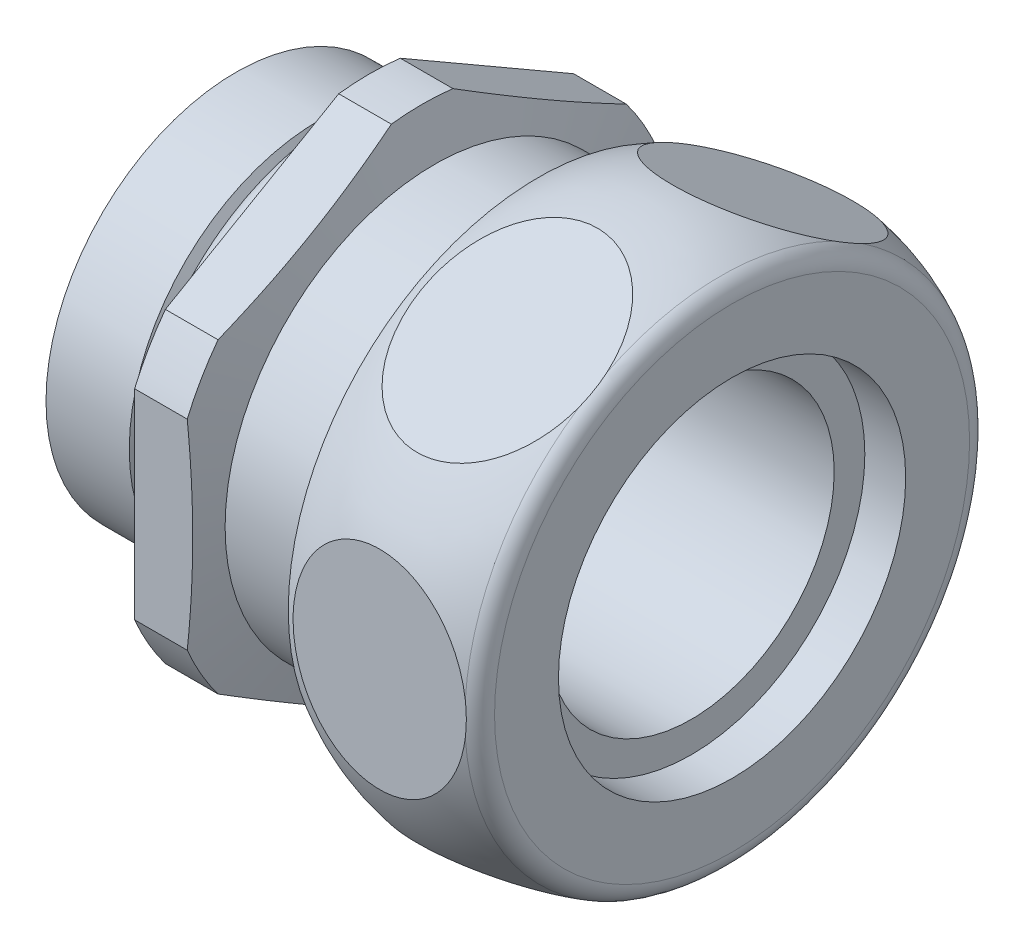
ISO-10303-21;
HEADER;
FILE_DESCRIPTION(('STEP AP214'),'2;1');
FILE_NAME('part.step','',(''),(''),'','','');
FILE_SCHEMA(('AUTOMOTIVE_DESIGN { 1 0 10303 214 1 1 1 1 }'));
ENDSEC;
DATA;
#1=APPLICATION_CONTEXT('core data for automotive mechanical design processes');
#2=APPLICATION_PROTOCOL_DEFINITION('international standard','automotive_design',2000,#1);
#3=PRODUCT_CONTEXT('',#1,'mechanical');
#4=PRODUCT('Part','Part','',(#3));
#5=PRODUCT_RELATED_PRODUCT_CATEGORY('part','',(#4));
#6=PRODUCT_DEFINITION_FORMATION('','',#4);
#7=PRODUCT_DEFINITION_CONTEXT('part definition',#1,'design');
#8=PRODUCT_DEFINITION('design','',#6,#7);
#9=PRODUCT_DEFINITION_SHAPE('','',#8);
#10=(LENGTH_UNIT() NAMED_UNIT(*) SI_UNIT(.MILLI.,.METRE.));
#11=(NAMED_UNIT(*) PLANE_ANGLE_UNIT() SI_UNIT($,.RADIAN.));
#12=(NAMED_UNIT(*) SI_UNIT($,.STERADIAN.) SOLID_ANGLE_UNIT());
#13=UNCERTAINTY_MEASURE_WITH_UNIT(LENGTH_MEASURE(1.E-05),#10,'distance_accuracy_value','');
#14=(GEOMETRIC_REPRESENTATION_CONTEXT(3) GLOBAL_UNCERTAINTY_ASSIGNED_CONTEXT((#13)) GLOBAL_UNIT_ASSIGNED_CONTEXT((#10,
#11,#12)) REPRESENTATION_CONTEXT('',''));
#15=CARTESIAN_POINT('',(0.,0.,0.));
#16=DIRECTION('',(0.,0.,1.));
#17=DIRECTION('',(1.,0.,0.));
#18=AXIS2_PLACEMENT_3D('',#15,#16,#17);
#19=CARTESIAN_POINT('',(-9.75000000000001,8.50000000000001,0.));
#20=DIRECTION('',(1.,0.,0.));
#21=DIRECTION('',(0.,0.,-1.));
#22=AXIS2_PLACEMENT_3D('',#19,#20,#21);
#23=PLANE('',#22);
#24=CARTESIAN_POINT('',(-9.75000000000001,0.,0.));
#25=DIRECTION('',(1.,0.,0.));
#26=DIRECTION('',(0.,1.,0.));
#27=AXIS2_PLACEMENT_3D('',#24,#25,#26);
#28=CIRCLE('',#27,6.99999999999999);
#29=CARTESIAN_POINT('',(-9.75000000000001,7.00000000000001,0.));
#30=VERTEX_POINT('',#29);
#31=EDGE_CURVE('E478',#30,#30,#28,.T.);
#32=ORIENTED_EDGE('',*,*,#31,.T.);
#33=EDGE_LOOP('',(#32));
#34=FACE_BOUND('',#33,.T.);
#35=CARTESIAN_POINT('',(-9.75000000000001,0.,0.));
#36=DIRECTION('',(-1.,0.,0.));
#37=DIRECTION('',(0.,0.,1.));
#38=AXIS2_PLACEMENT_3D('',#35,#36,#37);
#39=CIRCLE('',#38,8.5);
#40=CARTESIAN_POINT('',(-9.75000000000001,0.,8.50000000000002));
#41=VERTEX_POINT('',#40);
#42=EDGE_CURVE('E416',#41,#41,#39,.T.);
#43=ORIENTED_EDGE('',*,*,#42,.T.);
#44=EDGE_LOOP('',(#43));
#45=FACE_BOUND('',#44,.T.);
#46=ADVANCED_FACE('F54',(#34,#45),#23,.F.);
#47=CARTESIAN_POINT('',(-2.75,12.5,0.));
#48=DIRECTION('',(1.,0.,0.));
#49=DIRECTION('',(0.,0.,-1.));
#50=AXIS2_PLACEMENT_3D('',#47,#48,#49);
#51=PLANE('',#50);
#52=CARTESIAN_POINT('',(-2.75,0.,0.));
#53=DIRECTION('',(-1.,0.,0.));
#54=DIRECTION('',(0.,0.,1.));
#55=AXIS2_PLACEMENT_3D('',#52,#53,#54);
#56=CIRCLE('',#55,12.5);
#57=CARTESIAN_POINT('',(-2.75,4.89897948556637,11.5));
#58=VERTEX_POINT('',#57);
#59=CARTESIAN_POINT('',(-2.75,7.50980240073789,9.9926406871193));
#60=VERTEX_POINT('',#59);
#61=EDGE_CURVE('E437',#58,#60,#56,.T.);
#62=ORIENTED_EDGE('',*,*,#61,.T.);
#63=DIRECTION('',(0.,0.500000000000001,-0.866025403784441));
#64=VECTOR('',#63,1.);
#65=CARTESIAN_POINT('',(-2.75,13.0842921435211,0.337341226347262));
#66=LINE('',#65,#64);
#67=CARTESIAN_POINT('',(-2.75,12.4087818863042,1.50735931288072));
#68=VERTEX_POINT('',#67);
#69=EDGE_CURVE('E194',#60,#68,#66,.T.);
#70=ORIENTED_EDGE('',*,*,#69,.T.);
#71=CARTESIAN_POINT('',(-2.75,12.4087818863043,-1.5073593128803));
#72=VERTEX_POINT('',#71);
#73=EDGE_CURVE('E441',#68,#72,#56,.T.);
#74=ORIENTED_EDGE('',*,*,#73,.T.);
#75=DIRECTION('',(0.,-0.500000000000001,-0.86602540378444));
#76=VECTOR('',#75,1.);
#77=CARTESIAN_POINT('',(-2.75,13.0842921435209,-0.337341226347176));
#78=LINE('',#77,#76);
#79=CARTESIAN_POINT('',(-2.75,7.50980240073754,-9.99264068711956));
#80=VERTEX_POINT('',#79);
#81=EDGE_CURVE('E219',#72,#80,#78,.T.);
#82=ORIENTED_EDGE('',*,*,#81,.T.);
#83=CARTESIAN_POINT('',(-2.75,4.89897948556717,-11.4999999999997));
#84=VERTEX_POINT('',#83);
#85=EDGE_CURVE('E523',#80,#84,#56,.T.);
#86=ORIENTED_EDGE('',*,*,#85,.T.);
#87=DIRECTION('',(0.,-1.,0.));
#88=VECTOR('',#87,1.);
#89=CARTESIAN_POINT('',(-2.75,12.5,-11.4999999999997));
#90=LINE('',#89,#88);
#91=CARTESIAN_POINT('',(-2.75,-4.89897948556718,-11.4999999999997));
#92=VERTEX_POINT('',#91);
#93=EDGE_CURVE('E563',#84,#92,#90,.T.);
#94=ORIENTED_EDGE('',*,*,#93,.T.);
#95=CARTESIAN_POINT('',(-2.75,-7.50980240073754,-9.99264068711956));
#96=VERTEX_POINT('',#95);
#97=EDGE_CURVE('E520',#92,#96,#56,.T.);
#98=ORIENTED_EDGE('',*,*,#97,.T.);
#99=DIRECTION('',(0.,-0.500000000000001,0.866025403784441));
#100=VECTOR('',#99,1.);
#101=CARTESIAN_POINT('',(-2.75,-6.83429214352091,-11.1626587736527));
#102=LINE('',#101,#100);
#103=CARTESIAN_POINT('',(-2.75,-12.4087818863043,-1.50735931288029));
#104=VERTEX_POINT('',#103);
#105=EDGE_CURVE('E510',#96,#104,#102,.T.);
#106=ORIENTED_EDGE('',*,*,#105,.T.);
#107=CARTESIAN_POINT('',(-2.75,-12.4087818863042,1.50735931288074));
#108=VERTEX_POINT('',#107);
#109=EDGE_CURVE('E524',#104,#108,#56,.T.);
#110=ORIENTED_EDGE('',*,*,#109,.T.);
#111=DIRECTION('',(0.,0.500000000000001,0.86602540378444));
#112=VECTOR('',#111,1.);
#113=CARTESIAN_POINT('',(-2.75,-6.83429214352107,11.1626587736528));
#114=LINE('',#113,#112);
#115=CARTESIAN_POINT('',(-2.75,-7.5098024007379,9.99264068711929));
#116=VERTEX_POINT('',#115);
#117=EDGE_CURVE('E588',#108,#116,#114,.T.);
#118=ORIENTED_EDGE('',*,*,#117,.T.);
#119=CARTESIAN_POINT('',(-2.75,-4.89897948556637,11.5));
#120=VERTEX_POINT('',#119);
#121=EDGE_CURVE('E436',#116,#120,#56,.T.);
#122=ORIENTED_EDGE('',*,*,#121,.T.);
#123=DIRECTION('',(0.,1.,0.));
#124=VECTOR('',#123,1.);
#125=CARTESIAN_POINT('',(-2.75,12.5,11.5));
#126=LINE('',#125,#124);
#127=EDGE_CURVE('E590',#120,#58,#126,.T.);
#128=ORIENTED_EDGE('',*,*,#127,.T.);
#129=EDGE_LOOP('',(#62,#70,#74,#82,#86,#94,#98,#106,#110,#118,#122,#128));
#130=FACE_BOUND('',#129,.T.);
#131=CARTESIAN_POINT('',(-2.75,0.,0.));
#132=DIRECTION('',(1.,0.,0.));
#133=DIRECTION('',(0.,0.,-1.));
#134=AXIS2_PLACEMENT_3D('',#131,#132,#133);
#135=CIRCLE('',#134,10.0156854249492);
#136=CARTESIAN_POINT('',(-2.75,0.,-10.0156854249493));
#137=VERTEX_POINT('',#136);
#138=EDGE_CURVE('E13',#137,#137,#135,.F.);
#139=ORIENTED_EDGE('',*,*,#138,.F.);
#140=EDGE_LOOP('',(#139));
#141=FACE_BOUND('',#140,.T.);
#142=ADVANCED_FACE('F468',(#130,#141),#51,.F.);
#143=CARTESIAN_POINT('',(-2.75,0.,0.));
#144=DIRECTION('',(-1.,0.,0.));
#145=DIRECTION('',(0.,0.,1.));
#146=AXIS2_PLACEMENT_3D('',#143,#144,#145);
#147=CIRCLE('',#146,8.5);
#148=CARTESIAN_POINT('',(-2.75,0.,8.50000000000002));
#149=VERTEX_POINT('',#148);
#150=EDGE_CURVE('E432',#149,#149,#147,.T.);
#151=ORIENTED_EDGE('',*,*,#150,.F.);
#152=EDGE_LOOP('',(#151));
#153=FACE_BOUND('',#152,.T.);
#154=CARTESIAN_POINT('',(-2.75,0.,0.));
#155=DIRECTION('',(-1.,0.,0.));
#156=DIRECTION('',(0.,0.,1.));
#157=AXIS2_PLACEMENT_3D('',#154,#155,#156);
#158=CIRCLE('',#157,8.88431457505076);
#159=CARTESIAN_POINT('',(-2.75,0.,8.88431457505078));
#160=VERTEX_POINT('',#159);
#161=EDGE_CURVE('E63',#160,#160,#158,.F.);
#162=ORIENTED_EDGE('',*,*,#161,.F.);
#163=EDGE_LOOP('',(#162));
#164=FACE_BOUND('',#163,.T.);
#165=ADVANCED_FACE('F473',(#153,#164),#51,.F.);
#166=CARTESIAN_POINT('',(13.9999999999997,0.,0.));
#167=DIRECTION('',(-1.,0.,0.));
#168=DIRECTION('',(0.,0.,1.));
#169=AXIS2_PLACEMENT_3D('',#166,#167,#168);
#170=TOROIDAL_SURFACE('',#169,11.6280731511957,1.00000000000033);
#171=CARTESIAN_POINT('',(15.,0.,0.));
#172=DIRECTION('',(-1.,0.,0.));
#173=DIRECTION('',(0.,0.,1.));
#174=AXIS2_PLACEMENT_3D('',#171,#172,#173);
#175=CIRCLE('',#174,11.628073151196);
#176=CARTESIAN_POINT('',(15.,0.,11.628073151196));
#177=VERTEX_POINT('',#176);
#178=EDGE_CURVE('E216',#177,#177,#175,.T.);
#179=ORIENTED_EDGE('',*,*,#178,.T.);
#180=EDGE_LOOP('',(#179));
#181=FACE_BOUND('',#180,.T.);
#182=CARTESIAN_POINT('',(14.440976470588,10.425176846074,6.9430640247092));
#183=CARTESIAN_POINT('',(14.4495906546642,10.4583990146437,6.88552154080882));
#184=CARTESIAN_POINT('',(14.4568941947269,10.4916987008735,6.82784479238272));
#185=CARTESIAN_POINT('',(14.4691591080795,10.5583986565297,6.71231708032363));
#186=CARTESIAN_POINT('',(14.4741210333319,10.5917989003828,6.65446616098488));
#187=CARTESIAN_POINT('',(14.4858887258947,10.6918440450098,6.48118288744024));
#188=CARTESIAN_POINT('',(14.4896361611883,10.7585807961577,6.36559144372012));
#189=CARTESIAN_POINT('',(14.4896361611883,10.8920542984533,6.13440855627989));
#190=CARTESIAN_POINT('',(14.4858887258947,10.9587910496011,6.01881711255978));
#191=CARTESIAN_POINT('',(14.4741210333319,11.0588361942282,5.84553383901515));
#192=CARTESIAN_POINT('',(14.4691591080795,11.0922364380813,5.78768291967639));
#193=CARTESIAN_POINT('',(14.4568941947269,11.1589363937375,5.6721552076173));
#194=CARTESIAN_POINT('',(14.4495906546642,11.1922360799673,5.6144784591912));
#195=CARTESIAN_POINT('',(14.4409764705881,11.225458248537,5.55693597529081));
#196=B_SPLINE_CURVE_WITH_KNOTS('',3,(#182,#183,#184,#185,#186,#187,#188,#189,#190,#191,#192,
#193,#194,#195),.UNSPECIFIED.,.F.,.F.,(4,2,2,2,2,2,4),(0.,0.200964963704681,0.401882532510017,
0.802225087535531,1.20256764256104,1.40348521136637,1.60445017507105),.UNSPECIFIED.);
#197=CARTESIAN_POINT('',(14.441176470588,10.4259468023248,6.94173042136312));
#198=VERTEX_POINT('',#197);
#199=CARTESIAN_POINT('',(14.441176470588,11.2246882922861,5.55826957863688));
#200=VERTEX_POINT('',#199);
#201=EDGE_CURVE('E315',#198,#200,#196,.T.);
#202=ORIENTED_EDGE('',*,*,#201,.F.);
#203=CARTESIAN_POINT('',(14.441176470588,0.,0.));
#204=DIRECTION('',(-1.,0.,0.));
#205=DIRECTION('',(0.,0.,1.));
#206=AXIS2_PLACEMENT_3D('',#203,#204,#205);
#207=CIRCLE('',#206,12.525493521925);
#208=CARTESIAN_POINT('',(14.441176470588,0.798741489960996,12.5));
#209=VERTEX_POINT('',#208);
#210=EDGE_CURVE('E201',#209,#198,#207,.T.);
#211=ORIENTED_EDGE('',*,*,#210,.F.);
#212=CARTESIAN_POINT('',(14.4896361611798,0.,12.5));
#213=CARTESIAN_POINT('',(14.4896358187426,0.0794061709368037,12.5));
#214=CARTESIAN_POINT('',(14.488295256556,0.158811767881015,12.5));
#215=CARTESIAN_POINT('',(14.4828542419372,0.317476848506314,12.5));
#216=CARTESIAN_POINT('',(14.4787556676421,0.396736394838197,12.5));
#217=CARTESIAN_POINT('',(14.467541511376,0.555055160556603,12.5));
#218=CARTESIAN_POINT('',(14.4604255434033,0.634114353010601,12.5));
#219=CARTESIAN_POINT('',(14.4426818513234,0.791845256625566,12.5));
#220=CARTESIAN_POINT('',(14.4320544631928,0.870517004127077,12.5));
#221=CARTESIAN_POINT('',(14.4063796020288,1.02713743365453,12.5));
#222=CARTESIAN_POINT('',(14.3913322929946,1.10508614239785,12.5));
#223=CARTESIAN_POINT('',(14.3551975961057,1.25970719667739,12.5));
#224=CARTESIAN_POINT('',(14.3341098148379,1.33637945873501,12.5));
#225=CARTESIAN_POINT('',(14.2950595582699,1.44897918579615,12.5));
#226=CARTESIAN_POINT('',(14.2807759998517,1.48617163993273,12.5));
#227=CARTESIAN_POINT('',(14.2487415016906,1.55897605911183,12.5));
#228=CARTESIAN_POINT('',(14.2310030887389,1.59459318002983,12.5));
#229=CARTESIAN_POINT('',(14.2017850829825,1.64327459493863,12.5));
#230=CARTESIAN_POINT('',(14.1924886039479,1.65763823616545,12.5));
#231=CARTESIAN_POINT('',(14.172588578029,1.68552042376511,12.5));
#232=CARTESIAN_POINT('',(14.1619809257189,1.69903610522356,12.5));
#233=CARTESIAN_POINT('',(14.1389770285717,1.7248651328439,12.5));
#234=CARTESIAN_POINT('',(14.1265552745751,1.73715622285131,12.5));
#235=CARTESIAN_POINT('',(14.099663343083,1.75923777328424,12.5));
#236=CARTESIAN_POINT('',(14.0852077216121,1.76904472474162,12.5));
#237=CARTESIAN_POINT('',(14.0619513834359,1.78058899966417,12.5));
#238=CARTESIAN_POINT('',(14.0539424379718,1.78390834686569,12.5));
#239=CARTESIAN_POINT('',(14.0374949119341,1.78922676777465,12.5));
#240=CARTESIAN_POINT('',(14.0290568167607,1.79122729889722,12.5));
#241=CARTESIAN_POINT('',(14.0118976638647,1.79370552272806,12.5));
#242=CARTESIAN_POINT('',(14.0031751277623,1.7941732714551,12.5));
#243=CARTESIAN_POINT('',(13.9857913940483,1.79349849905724,12.5));
#244=CARTESIAN_POINT('',(13.9771302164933,1.79235547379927,12.5));
#245=CARTESIAN_POINT('',(13.9607449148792,1.78873113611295,12.5));
#246=CARTESIAN_POINT('',(13.9529978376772,1.78635017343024,12.5));
#247=CARTESIAN_POINT('',(13.9379221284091,1.78052078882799,12.5));
#248=CARTESIAN_POINT('',(13.9305936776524,1.77707190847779,12.5));
#249=CARTESIAN_POINT('',(13.911343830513,1.76655779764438,12.5));
#250=CARTESIAN_POINT('',(13.899875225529,1.75866785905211,12.5));
#251=CARTESIAN_POINT('',(13.8782479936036,1.74125822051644,12.5));
#252=CARTESIAN_POINT('',(13.8680941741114,1.7317328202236,12.5));
#253=CARTESIAN_POINT('',(13.8396184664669,1.70192155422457,12.5));
#254=CARTESIAN_POINT('',(13.8228895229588,1.68013523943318,12.5));
#255=CARTESIAN_POINT('',(13.7923926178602,1.63462719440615,12.5));
#256=CARTESIAN_POINT('',(13.7786330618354,1.61090022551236,12.5));
#257=CARTESIAN_POINT('',(13.7447325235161,1.5461190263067,12.5));
#258=CARTESIAN_POINT('',(13.7264769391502,1.50408772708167,12.5));
#259=CARTESIAN_POINT('',(13.6937153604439,1.41856174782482,12.5));
#260=CARTESIAN_POINT('',(13.6792186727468,1.37506373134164,12.5));
#261=CARTESIAN_POINT('',(13.6528881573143,1.28698238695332,12.5));
#262=CARTESIAN_POINT('',(13.6410713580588,1.24239400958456,12.5));
#263=CARTESIAN_POINT('',(13.6195928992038,1.15277102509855,12.5));
#264=CARTESIAN_POINT('',(13.6099286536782,1.10773702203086,12.5));
#265=CARTESIAN_POINT('',(13.585710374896,0.983405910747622,12.5));
#266=CARTESIAN_POINT('',(13.5729309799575,0.903763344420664,12.5));
#267=CARTESIAN_POINT('',(13.5513620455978,0.743929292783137,12.5));
#268=CARTESIAN_POINT('',(13.542574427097,0.663737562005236,12.5));
#269=CARTESIAN_POINT('',(13.5210949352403,0.422381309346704,12.5));
#270=CARTESIAN_POINT('',(13.5133441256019,0.26077140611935,12.5));
#271=CARTESIAN_POINT('',(13.5087952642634,-0.0617677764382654,12.5));
#272=CARTESIAN_POINT('',(13.5119424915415,-0.222696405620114,12.5));
#273=CARTESIAN_POINT('',(13.52548508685,-0.463444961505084,12.5));
#274=CARTESIAN_POINT('',(13.5314609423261,-0.543520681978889,12.5));
#275=CARTESIAN_POINT('',(13.5467843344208,-0.703341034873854,12.5));
#276=CARTESIAN_POINT('',(13.5561310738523,-0.783085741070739,12.5));
#277=CARTESIAN_POINT('',(13.5770463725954,-0.928813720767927,12.5));
#278=CARTESIAN_POINT('',(13.5879889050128,-0.994884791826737,12.5));
#279=CARTESIAN_POINT('',(13.6135535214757,-1.12655854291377,12.5));
#280=CARTESIAN_POINT('',(13.6281884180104,-1.1921587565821,12.5));
#281=CARTESIAN_POINT('',(13.6626022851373,-1.32277146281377,12.5));
#282=CARTESIAN_POINT('',(13.6824292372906,-1.3877722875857,12.5));
#283=CARTESIAN_POINT('',(13.7181381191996,-1.48283038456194,12.5));
#284=CARTESIAN_POINT('',(13.7309875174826,-1.51401755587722,12.5));
#285=CARTESIAN_POINT('',(13.7594028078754,-1.57511092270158,12.5));
#286=CARTESIAN_POINT('',(13.7749627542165,-1.60501974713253,12.5));
#287=CARTESIAN_POINT('',(13.8012790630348,-1.648070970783,12.5));
#288=CARTESIAN_POINT('',(13.8105455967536,-1.66211737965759,12.5));
#289=CARTESIAN_POINT('',(13.8303729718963,-1.68935807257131,12.5));
#290=CARTESIAN_POINT('',(13.8409380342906,-1.7025493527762,12.5));
#291=CARTESIAN_POINT('',(13.8638371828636,-1.72771473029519,12.5));
#292=CARTESIAN_POINT('',(13.8761966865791,-1.7396661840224,12.5));
#293=CARTESIAN_POINT('',(13.9029215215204,-1.76105913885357,12.5));
#294=CARTESIAN_POINT('',(13.9172727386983,-1.77051705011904,12.5));
#295=CARTESIAN_POINT('',(13.9403916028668,-1.78160081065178,12.5));
#296=CARTESIAN_POINT('',(13.9484058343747,-1.78478595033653,12.5));
#297=CARTESIAN_POINT('',(13.9648441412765,-1.78982612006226,12.5));
#298=CARTESIAN_POINT('',(13.9732677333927,-1.79168267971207,12.5));
#299=CARTESIAN_POINT('',(13.9903671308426,-1.79387517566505,12.5));
#300=CARTESIAN_POINT('',(13.9990441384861,-1.79420199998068,12.5));
#301=CARTESIAN_POINT('',(14.0163137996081,-1.79326890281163,12.5));
#302=CARTESIAN_POINT('',(14.0249064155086,-1.79200830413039,12.5));
#303=CARTESIAN_POINT('',(14.041203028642,-1.78817674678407,12.5));
#304=CARTESIAN_POINT('',(14.048928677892,-1.78569498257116,12.5));
#305=CARTESIAN_POINT('',(14.0639529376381,-1.77967984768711,12.5));
#306=CARTESIAN_POINT('',(14.0712513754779,-1.77614605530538,12.5));
#307=CARTESIAN_POINT('',(14.0906174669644,-1.7653102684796,12.5));
#308=CARTESIAN_POINT('',(14.1022067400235,-1.75715757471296,12.5));
#309=CARTESIAN_POINT('',(14.1240398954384,-1.73921333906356,12.5));
#310=CARTESIAN_POINT('',(14.134278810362,-1.72941603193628,12.5));
#311=CARTESIAN_POINT('',(14.1631449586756,-1.69861776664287,12.5));
#312=CARTESIAN_POINT('',(14.1801098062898,-1.67608050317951,12.5));
#313=CARTESIAN_POINT('',(14.2110014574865,-1.62905122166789,12.5));
#314=CARTESIAN_POINT('',(14.2249187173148,-1.60455338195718,12.5));
#315=CARTESIAN_POINT('',(14.2593905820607,-1.53728732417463,12.5));
#316=CARTESIAN_POINT('',(14.2779537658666,-1.49350834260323,12.5));
#317=CARTESIAN_POINT('',(14.3111887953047,-1.4044720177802,12.5));
#318=CARTESIAN_POINT('',(14.3258510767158,-1.3592113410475,12.5));
#319=CARTESIAN_POINT('',(14.3523907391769,-1.26767606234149,12.5));
#320=CARTESIAN_POINT('',(14.3642558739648,-1.2213979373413,12.5));
#321=CARTESIAN_POINT('',(14.3857648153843,-1.12839334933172,12.5));
#322=CARTESIAN_POINT('',(14.39541096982,-1.08166741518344,12.5));
#323=CARTESIAN_POINT('',(14.4200600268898,-0.949698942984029,12.5));
#324=CARTESIAN_POINT('',(14.4330283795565,-0.864076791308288,12.5));
#325=CARTESIAN_POINT('',(14.4545733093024,-0.692265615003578,12.5));
#326=CARTESIAN_POINT('',(14.4631475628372,-0.606076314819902,12.5));
#327=CARTESIAN_POINT('',(14.4766314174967,-0.433301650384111,12.5));
#328=CARTESIAN_POINT('',(14.4815361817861,-0.346715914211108,12.5));
#329=CARTESIAN_POINT('',(14.4880388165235,-0.173419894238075,12.5));
#330=CARTESIAN_POINT('',(14.4896365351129,-0.0867096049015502,12.5));
#331=CARTESIAN_POINT('',(14.4896361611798,0.,12.5));
#332=B_SPLINE_CURVE_WITH_KNOTS('',3,(#212,#213,#214,#215,#216,#217,#218,#219,#220,#221,#222,
#223,#224,#225,#226,#227,#228,#229,#230,#231,#232,#233,#234,#235,#236,#237,#238,#239,#240,#241,
#242,#243,#244,#245,#246,#247,#248,#249,#250,#251,#252,#253,#254,#255,#256,#257,#258,#259,#260,
#261,#262,#263,#264,#265,#266,#267,#268,#269,#270,#271,#272,#273,#274,#275,#276,#277,#278,#279,
#280,#281,#282,#283,#284,#285,#286,#287,#288,#289,#290,#291,#292,#293,#294,#295,#296,#297,#298,
#299,#300,#301,#302,#303,#304,#305,#306,#307,#308,#309,#310,#311,#312,#313,#314,#315,#316,#317,
#318,#319,#320,#321,#322,#323,#324,#325,#326,#327,#328,#329,#330,#331),.UNSPECIFIED.,.T.,.F.,(4,
2,2,2,2,2,2,2,2,2,2,2,2,2,2,2,2,2,2,2,2,2,2,2,2,2,2,2,2,2,2,2,2,2,2,2,2,2,2,2,2,2,2,2,2,2,2,2,2,
2,2,2,2,2,2,2,2,2,2,4),(0.,0.238205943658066,0.4762498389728,0.714324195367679,
0.952375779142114,1.19041853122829,1.42847679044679,1.54790929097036,1.66691654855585,
1.71819691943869,1.76964212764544,1.82189654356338,1.87379439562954,1.89971199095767,
1.92560089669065,1.95165742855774,1.97772211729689,2.00194369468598,2.02617568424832,
2.06769337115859,2.10935881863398,2.19130291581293,2.27347601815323,2.41059785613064,
2.54805602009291,2.68636456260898,2.82450604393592,3.06633757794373,3.30828536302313,
3.79319934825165,4.27568203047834,4.51652267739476,4.75730640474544,4.95813604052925,
5.15967237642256,5.36314127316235,5.46425920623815,5.56515806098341,5.61559216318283,
5.66619477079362,5.71760058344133,5.76865913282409,5.79443851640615,5.82018817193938,
5.8460910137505,5.87200490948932,5.89625735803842,5.92051954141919,5.9627797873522,
6.00519139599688,6.08934540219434,6.17375928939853,6.31604878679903,6.45868399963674,
6.60193254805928,6.74502882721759,7.00465303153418,7.26441438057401,7.52451752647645,
7.78463261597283),.UNSPECIFIED.);
#333=CARTESIAN_POINT('',(14.441176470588,-0.798741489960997,12.5));
#334=VERTEX_POINT('',#333);
#335=EDGE_CURVE('E188',#334,#209,#332,.T.);
#336=ORIENTED_EDGE('',*,*,#335,.F.);
#337=CARTESIAN_POINT('',(14.441176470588,-10.4259468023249,6.94173042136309));
#338=VERTEX_POINT('',#337);
#339=EDGE_CURVE('E200',#338,#334,#207,.T.);
#340=ORIENTED_EDGE('',*,*,#339,.F.);
#341=CARTESIAN_POINT('',(14.440976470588,-11.225458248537,5.55693597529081));
#342=CARTESIAN_POINT('',(14.4495906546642,-11.1922360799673,5.61447845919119));
#343=CARTESIAN_POINT('',(14.4568941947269,-11.1589363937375,5.67215520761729));
#344=CARTESIAN_POINT('',(14.4691591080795,-11.0922364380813,5.78768291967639));
#345=CARTESIAN_POINT('',(14.4741210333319,-11.0588361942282,5.84553383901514));
#346=CARTESIAN_POINT('',(14.4858887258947,-10.9587910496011,6.01881711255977));
#347=CARTESIAN_POINT('',(14.4896361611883,-10.8920542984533,6.13440855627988));
#348=CARTESIAN_POINT('',(14.4896361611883,-10.7585807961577,6.36559144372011));
#349=CARTESIAN_POINT('',(14.4858887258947,-10.6918440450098,6.48118288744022));
#350=CARTESIAN_POINT('',(14.4741210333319,-10.5917989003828,6.65446616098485));
#351=CARTESIAN_POINT('',(14.4691591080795,-10.5583986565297,6.71231708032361));
#352=CARTESIAN_POINT('',(14.4568941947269,-10.4916987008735,6.8278447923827));
#353=CARTESIAN_POINT('',(14.4495906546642,-10.4583990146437,6.8855215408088));
#354=CARTESIAN_POINT('',(14.4409764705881,-10.425176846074,6.94306402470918));
#355=B_SPLINE_CURVE_WITH_KNOTS('',3,(#341,#342,#343,#344,#345,#346,#347,#348,#349,#350,#351,
#352,#353,#354),.UNSPECIFIED.,.F.,.F.,(4,2,2,2,2,2,4),(0.,0.200964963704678,0.401882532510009,
0.802225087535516,1.20256764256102,1.40348521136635,1.60445017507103),.UNSPECIFIED.);
#356=CARTESIAN_POINT('',(14.441176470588,-11.2246882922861,5.55826957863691));
#357=VERTEX_POINT('',#356);
#358=EDGE_CURVE('E69',#357,#338,#355,.T.);
#359=ORIENTED_EDGE('',*,*,#358,.F.);
#360=CARTESIAN_POINT('',(14.441176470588,-11.224688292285,-5.55826957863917));
#361=VERTEX_POINT('',#360);
#362=EDGE_CURVE('E207',#361,#357,#207,.T.);
#363=ORIENTED_EDGE('',*,*,#362,.F.);
#364=CARTESIAN_POINT('',(14.440976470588,-10.4251768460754,-6.94306402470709));
#365=CARTESIAN_POINT('',(14.4495906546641,-10.458399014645,-6.88552154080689));
#366=CARTESIAN_POINT('',(14.4568941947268,-10.4916987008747,-6.82784479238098));
#367=CARTESIAN_POINT('',(14.4691591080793,-10.5583986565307,-6.71231708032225));
#368=CARTESIAN_POINT('',(14.4741210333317,-10.5917989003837,-6.65446616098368));
#369=CARTESIAN_POINT('',(14.4858887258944,-10.6918440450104,-6.4811828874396));
#370=CARTESIAN_POINT('',(14.489636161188,-10.758580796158,-6.36559144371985));
#371=CARTESIAN_POINT('',(14.489636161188,-10.8920542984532,-6.13440855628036));
#372=CARTESIAN_POINT('',(14.4858887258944,-10.9587910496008,-6.01881711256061));
#373=CARTESIAN_POINT('',(14.4741210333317,-11.0588361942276,-5.84553383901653));
#374=CARTESIAN_POINT('',(14.4691591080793,-11.0922364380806,-5.78768291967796));
#375=CARTESIAN_POINT('',(14.4568941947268,-11.1589363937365,-5.67215520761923));
#376=CARTESIAN_POINT('',(14.4495906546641,-11.1922360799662,-5.61447845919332));
#377=CARTESIAN_POINT('',(14.4409764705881,-11.2254582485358,-5.55693597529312));
#378=B_SPLINE_CURVE_WITH_KNOTS('',3,(#364,#365,#366,#367,#368,#369,#370,#371,#372,#373,#374,
#375,#376,#377),.UNSPECIFIED.,.F.,.F.,(4,2,2,2,2,2,4),(0.,0.200964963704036,0.401882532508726,
0.802225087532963,1.2025676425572,1.40348521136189,1.60445017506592),.UNSPECIFIED.);
#379=CARTESIAN_POINT('',(14.441176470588,-10.4259468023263,-6.94173042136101));
#380=VERTEX_POINT('',#379);
#381=EDGE_CURVE('E76',#380,#361,#378,.T.);
#382=ORIENTED_EDGE('',*,*,#381,.F.);
#383=CARTESIAN_POINT('',(14.441176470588,-0.798741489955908,-12.5000000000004));
#384=VERTEX_POINT('',#383);
#385=EDGE_CURVE('E210',#384,#380,#207,.T.);
#386=ORIENTED_EDGE('',*,*,#385,.F.);
#387=CARTESIAN_POINT('',(14.4896361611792,0.,-12.5000000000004));
#388=CARTESIAN_POINT('',(14.4896358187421,-0.0794061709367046,-12.5000000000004));
#389=CARTESIAN_POINT('',(14.4882952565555,-0.158811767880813,-12.5000000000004));
#390=CARTESIAN_POINT('',(14.4828542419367,-0.31747684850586,-12.5000000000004));
#391=CARTESIAN_POINT('',(14.4787556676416,-0.396736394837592,-12.5000000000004));
#392=CARTESIAN_POINT('',(14.4675415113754,-0.555055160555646,-12.5000000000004));
#393=CARTESIAN_POINT('',(14.4604255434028,-0.634114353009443,-12.5000000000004));
#394=CARTESIAN_POINT('',(14.442681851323,-0.79184525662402,-12.5000000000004));
#395=CARTESIAN_POINT('',(14.4320544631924,-0.870517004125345,-12.5000000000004));
#396=CARTESIAN_POINT('',(14.4063796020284,-1.02713743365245,-12.5000000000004));
#397=CARTESIAN_POINT('',(14.3913322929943,-1.1050861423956,-12.5000000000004));
#398=CARTESIAN_POINT('',(14.3551975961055,-1.25970719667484,-12.5000000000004));
#399=CARTESIAN_POINT('',(14.3341098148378,-1.33637945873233,-12.5000000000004));
#400=CARTESIAN_POINT('',(14.2950595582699,-1.44897918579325,-12.5000000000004));
#401=CARTESIAN_POINT('',(14.2807759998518,-1.48617163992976,-12.5000000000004));
#402=CARTESIAN_POINT('',(14.2487415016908,-1.55897605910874,-12.5000000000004));
#403=CARTESIAN_POINT('',(14.2310030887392,-1.5945931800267,-12.5000000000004));
#404=CARTESIAN_POINT('',(14.2017850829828,-1.6432745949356,-12.5000000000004));
#405=CARTESIAN_POINT('',(14.1924886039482,-1.65763823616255,-12.5000000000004));
#406=CARTESIAN_POINT('',(14.1725885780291,-1.68552042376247,-12.5000000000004));
#407=CARTESIAN_POINT('',(14.161980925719,-1.69903610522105,-12.5000000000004));
#408=CARTESIAN_POINT('',(14.1389770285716,-1.72486513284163,-12.5000000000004));
#409=CARTESIAN_POINT('',(14.1265552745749,-1.73715622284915,-12.5000000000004));
#410=CARTESIAN_POINT('',(14.0996633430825,-1.75923777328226,-12.5000000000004));
#411=CARTESIAN_POINT('',(14.0852077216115,-1.76904472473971,-12.5000000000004));
#412=CARTESIAN_POINT('',(14.0619513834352,-1.7805889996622,-12.5000000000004));
#413=CARTESIAN_POINT('',(14.053942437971,-1.78390834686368,-12.5000000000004));
#414=CARTESIAN_POINT('',(14.0374949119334,-1.78922676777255,-12.5000000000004));
#415=CARTESIAN_POINT('',(14.02905681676,-1.7912272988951,-12.5000000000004));
#416=CARTESIAN_POINT('',(14.011897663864,-1.79370552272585,-12.5000000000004));
#417=CARTESIAN_POINT('',(14.0031751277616,-1.79417327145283,-12.5000000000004));
#418=CARTESIAN_POINT('',(13.9857913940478,-1.7934984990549,-12.5000000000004));
#419=CARTESIAN_POINT('',(13.9771302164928,-1.79235547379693,-12.5000000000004));
#420=CARTESIAN_POINT('',(13.9607449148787,-1.78873113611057,-12.5000000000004));
#421=CARTESIAN_POINT('',(13.9529978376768,-1.78635017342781,-12.5000000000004));
#422=CARTESIAN_POINT('',(13.9379221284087,-1.7805207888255,-12.5000000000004));
#423=CARTESIAN_POINT('',(13.930593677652,-1.77707190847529,-12.5000000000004));
#424=CARTESIAN_POINT('',(13.9113438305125,-1.76655779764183,-12.5000000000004));
#425=CARTESIAN_POINT('',(13.8998752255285,-1.75866785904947,-12.5000000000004));
#426=CARTESIAN_POINT('',(13.8782479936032,-1.74125822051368,-12.5000000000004));
#427=CARTESIAN_POINT('',(13.868094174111,-1.73173282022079,-12.5000000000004));
#428=CARTESIAN_POINT('',(13.8396184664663,-1.70192155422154,-12.5000000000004));
#429=CARTESIAN_POINT('',(13.8228895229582,-1.68013523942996,-12.5000000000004));
#430=CARTESIAN_POINT('',(13.7923926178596,-1.63462719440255,-12.5000000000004));
#431=CARTESIAN_POINT('',(13.7786330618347,-1.61090022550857,-12.5000000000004));
#432=CARTESIAN_POINT('',(13.7447325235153,-1.54611902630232,-12.5000000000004));
#433=CARTESIAN_POINT('',(13.7264769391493,-1.50408772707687,-12.5000000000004));
#434=CARTESIAN_POINT('',(13.6937153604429,-1.41856174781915,-12.5000000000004));
#435=CARTESIAN_POINT('',(13.6792186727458,-1.37506373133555,-12.5000000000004));
#436=CARTESIAN_POINT('',(13.6528881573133,-1.28698238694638,-12.5000000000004));
#437=CARTESIAN_POINT('',(13.6410713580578,-1.2423940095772,-12.5000000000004));
#438=CARTESIAN_POINT('',(13.6195928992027,-1.15277102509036,-12.5000000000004));
#439=CARTESIAN_POINT('',(13.6099286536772,-1.10773702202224,-12.5000000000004));
#440=CARTESIAN_POINT('',(13.5857103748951,-0.98340591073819,-12.5000000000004));
#441=CARTESIAN_POINT('',(13.5729309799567,-0.903763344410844,-12.5000000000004));
#442=CARTESIAN_POINT('',(13.5513620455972,-0.743929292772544,-12.5000000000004));
#443=CARTESIAN_POINT('',(13.5425744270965,-0.663737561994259,-12.5000000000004));
#444=CARTESIAN_POINT('',(13.5210949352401,-0.422381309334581,-12.5000000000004));
#445=CARTESIAN_POINT('',(13.513344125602,-0.260771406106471,-12.5000000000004));
#446=CARTESIAN_POINT('',(13.5087952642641,0.0617677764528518,-12.5000000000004));
#447=CARTESIAN_POINT('',(13.5119424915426,0.222696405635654,-12.5000000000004));
#448=CARTESIAN_POINT('',(13.5254850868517,0.463444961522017,-12.5000000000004));
#449=CARTESIAN_POINT('',(13.5314609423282,0.54352068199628,-12.5000000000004));
#450=CARTESIAN_POINT('',(13.5467843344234,0.703341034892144,-12.5000000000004));
#451=CARTESIAN_POINT('',(13.5561310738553,0.78308574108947,-12.5000000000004));
#452=CARTESIAN_POINT('',(13.5770463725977,0.928813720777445,-12.5000000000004));
#453=CARTESIAN_POINT('',(13.5879889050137,0.994884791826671,-12.5000000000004));
#454=CARTESIAN_POINT('',(13.6135535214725,1.12655854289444,-12.5000000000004));
#455=CARTESIAN_POINT('',(13.6281884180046,1.19215875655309,-12.5000000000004));
#456=CARTESIAN_POINT('',(13.6626022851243,1.32277146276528,-12.5000000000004));
#457=CARTESIAN_POINT('',(13.682429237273,1.38777228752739,-12.5000000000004));
#458=CARTESIAN_POINT('',(13.7181381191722,1.48283038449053,-12.5000000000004));
#459=CARTESIAN_POINT('',(13.7309875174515,1.5140175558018,-12.5000000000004));
#460=CARTESIAN_POINT('',(13.7594028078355,1.57511092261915,-12.5000000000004));
#461=CARTESIAN_POINT('',(13.7749627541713,1.60501974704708,-12.5000000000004));
#462=CARTESIAN_POINT('',(13.8012790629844,1.64807097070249,-12.5000000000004));
#463=CARTESIAN_POINT('',(13.8105455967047,1.66211737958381,-12.5000000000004));
#464=CARTESIAN_POINT('',(13.830372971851,1.68935807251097,-12.5000000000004));
#465=CARTESIAN_POINT('',(13.8409380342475,1.70254935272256,-12.5000000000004));
#466=CARTESIAN_POINT('',(13.8638371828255,1.72771473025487,-12.5000000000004));
#467=CARTESIAN_POINT('',(13.876196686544,1.73966618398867,-12.5000000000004));
#468=CARTESIAN_POINT('',(13.9029215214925,1.76105913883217,-12.5000000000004));
#469=CARTESIAN_POINT('',(13.9172727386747,1.77051705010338,-12.5000000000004));
#470=CARTESIAN_POINT('',(13.9403916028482,1.78160081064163,-12.5000000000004));
#471=CARTESIAN_POINT('',(13.9484058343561,1.78478595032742,-12.5000000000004));
#472=CARTESIAN_POINT('',(13.9648441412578,1.78982612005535,-12.5000000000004));
#473=CARTESIAN_POINT('',(13.9732677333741,1.79168267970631,-12.5000000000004));
#474=CARTESIAN_POINT('',(13.9903671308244,1.79387517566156,-12.5000000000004));
#475=CARTESIAN_POINT('',(13.9990441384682,1.79420199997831,-12.5000000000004));
#476=CARTESIAN_POINT('',(14.016313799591,1.79326890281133,-12.5000000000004));
#477=CARTESIAN_POINT('',(14.0249064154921,1.79200830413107,-12.5000000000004));
#478=CARTESIAN_POINT('',(14.0412030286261,1.78817674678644,-12.5000000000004));
#479=CARTESIAN_POINT('',(14.0489286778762,1.78569498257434,-12.5000000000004));
#480=CARTESIAN_POINT('',(14.0639529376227,1.77967984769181,-12.5000000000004));
#481=CARTESIAN_POINT('',(14.0712513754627,1.77614605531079,-12.5000000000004));
#482=CARTESIAN_POINT('',(14.0906174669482,1.76531026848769,-12.5000000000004));
#483=CARTESIAN_POINT('',(14.1022067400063,1.75715757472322,-12.5000000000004));
#484=CARTESIAN_POINT('',(14.1240398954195,1.73921333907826,-12.5000000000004));
#485=CARTESIAN_POINT('',(14.1342788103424,1.72941603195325,-12.5000000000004));
#486=CARTESIAN_POINT('',(14.1631449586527,1.69861776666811,-12.5000000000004));
#487=CARTESIAN_POINT('',(14.1801098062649,1.67608050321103,-12.5000000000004));
#488=CARTESIAN_POINT('',(14.2110014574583,1.62905122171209,-12.5000000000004));
#489=CARTESIAN_POINT('',(14.2249187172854,1.60455338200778,-12.5000000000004));
#490=CARTESIAN_POINT('',(14.2593905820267,1.53728732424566,-12.5000000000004));
#491=CARTESIAN_POINT('',(14.2779537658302,1.49350834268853,-12.5000000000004));
#492=CARTESIAN_POINT('',(14.3111887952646,1.40447201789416,-12.5000000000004));
#493=CARTESIAN_POINT('',(14.3258510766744,1.35921134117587,-12.5000000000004));
#494=CARTESIAN_POINT('',(14.3523907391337,1.26767606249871,-12.5000000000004));
#495=CARTESIAN_POINT('',(14.3642558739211,1.22139793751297,-12.5000000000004));
#496=CARTESIAN_POINT('',(14.3857648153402,1.12839334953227,-12.5000000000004));
#497=CARTESIAN_POINT('',(14.3954109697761,1.08166741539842,-12.5000000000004));
#498=CARTESIAN_POINT('',(14.4200600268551,0.949698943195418,-12.5000000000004));
#499=CARTESIAN_POINT('',(14.4330283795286,0.864076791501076,-12.5000000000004));
#500=CARTESIAN_POINT('',(14.4545733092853,0.692265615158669,-12.5000000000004));
#501=CARTESIAN_POINT('',(14.4631475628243,0.606076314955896,-12.5000000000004));
#502=CARTESIAN_POINT('',(14.4766314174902,0.433301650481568,-12.5000000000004));
#503=CARTESIAN_POINT('',(14.4815361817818,0.346715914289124,-12.5000000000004));
#504=CARTESIAN_POINT('',(14.4880388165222,0.173419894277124,-12.5000000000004));
#505=CARTESIAN_POINT('',(14.4896365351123,0.0867096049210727,-12.5000000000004));
#506=CARTESIAN_POINT('',(14.4896361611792,0.,-12.5000000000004));
#507=B_SPLINE_CURVE_WITH_KNOTS('',3,(#387,#388,#389,#390,#391,#392,#393,#394,#395,#396,#397,
#398,#399,#400,#401,#402,#403,#404,#405,#406,#407,#408,#409,#410,#411,#412,#413,#414,#415,#416,
#417,#418,#419,#420,#421,#422,#423,#424,#425,#426,#427,#428,#429,#430,#431,#432,#433,#434,#435,
#436,#437,#438,#439,#440,#441,#442,#443,#444,#445,#446,#447,#448,#449,#450,#451,#452,#453,#454,
#455,#456,#457,#458,#459,#460,#461,#462,#463,#464,#465,#466,#467,#468,#469,#470,#471,#472,#473,
#474,#475,#476,#477,#478,#479,#480,#481,#482,#483,#484,#485,#486,#487,#488,#489,#490,#491,#492,
#493,#494,#495,#496,#497,#498,#499,#500,#501,#502,#503,#504,#505,#506),.UNSPECIFIED.,.T.,.F.,(4,
2,2,2,2,2,2,2,2,2,2,2,2,2,2,2,2,2,2,2,2,2,2,2,2,2,2,2,2,2,2,2,2,2,2,2,2,2,2,2,2,2,2,2,2,2,2,2,2,
2,2,2,2,2,2,2,2,2,2,4),(0.,0.23820594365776,0.476249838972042,0.714324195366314,
0.952375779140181,1.19041853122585,1.42847679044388,1.5479092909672,1.66691654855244,
1.71819691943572,1.76964212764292,1.82189654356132,1.87379439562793,1.89971199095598,
1.92560089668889,1.95165742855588,1.97772211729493,2.00194369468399,2.0261756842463,
2.06769337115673,2.10935881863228,2.19130291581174,2.27347601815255,2.41059785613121,
2.54805602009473,2.68636456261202,2.82450604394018,3.0663375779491,3.30828536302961,
3.79319934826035,4.27568203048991,4.51652267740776,4.75730640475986,4.95813604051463,
5.15967237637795,5.36314127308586,5.4642592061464,5.56515806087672,5.61559216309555,
5.66619477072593,5.71760058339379,5.7686591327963,5.79443851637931,5.82018817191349,
5.84609101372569,5.87200490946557,5.89625735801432,5.92051954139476,5.96277978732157,
6.00519139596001,6.08934540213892,6.17375928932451,6.31604878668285,6.4586839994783,
6.6019325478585,6.74502882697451,7.00465303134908,7.26441438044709,7.52451752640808,
7.78463261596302),.UNSPECIFIED.);
#508=CARTESIAN_POINT('',(14.441176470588,0.798741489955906,-12.5000000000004));
#509=VERTEX_POINT('',#508);
#510=EDGE_CURVE('E233',#509,#384,#507,.T.);
#511=ORIENTED_EDGE('',*,*,#510,.F.);
#512=CARTESIAN_POINT('',(14.441176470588,10.4259468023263,-6.94173042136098));
#513=VERTEX_POINT('',#512);
#514=EDGE_CURVE('E221',#513,#509,#207,.T.);
#515=ORIENTED_EDGE('',*,*,#514,.F.);
#516=CARTESIAN_POINT('',(14.440976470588,11.2254582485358,-5.55693597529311));
#517=CARTESIAN_POINT('',(14.4495906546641,11.1922360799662,-5.6144784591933));
#518=CARTESIAN_POINT('',(14.4568941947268,11.1589363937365,-5.67215520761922));
#519=CARTESIAN_POINT('',(14.4691591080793,11.0922364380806,-5.78768291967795));
#520=CARTESIAN_POINT('',(14.4741210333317,11.0588361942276,-5.84553383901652));
#521=CARTESIAN_POINT('',(14.4858887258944,10.9587910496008,-6.0188171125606));
#522=CARTESIAN_POINT('',(14.489636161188,10.8920542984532,-6.13440855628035));
#523=CARTESIAN_POINT('',(14.489636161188,10.758580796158,-6.36559144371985));
#524=CARTESIAN_POINT('',(14.4858887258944,10.6918440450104,-6.4811828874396));
#525=CARTESIAN_POINT('',(14.4741210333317,10.5917989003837,-6.65446616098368));
#526=CARTESIAN_POINT('',(14.4691591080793,10.5583986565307,-6.71231708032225));
#527=CARTESIAN_POINT('',(14.4568941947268,10.4916987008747,-6.82784479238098));
#528=CARTESIAN_POINT('',(14.4495906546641,10.458399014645,-6.88552154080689));
#529=CARTESIAN_POINT('',(14.4409764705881,10.4251768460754,-6.9430640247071));
#530=B_SPLINE_CURVE_WITH_KNOTS('',3,(#516,#517,#518,#519,#520,#521,#522,#523,#524,#525,#526,
#527,#528,#529),.UNSPECIFIED.,.F.,.F.,(4,2,2,2,2,2,4),(0.,0.200964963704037,0.40188253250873,
0.802225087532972,1.20256764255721,1.4034852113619,1.60445017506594),.UNSPECIFIED.);
#531=CARTESIAN_POINT('',(14.441176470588,11.224688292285,-5.5582695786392));
#532=VERTEX_POINT('',#531);
#533=EDGE_CURVE('E235',#532,#513,#530,.T.);
#534=ORIENTED_EDGE('',*,*,#533,.F.);
#535=EDGE_CURVE('E217',#200,#532,#207,.T.);
#536=ORIENTED_EDGE('',*,*,#535,.F.);
#537=EDGE_LOOP('',(#202,#211,#336,#340,#359,#363,#382,#386,#511,#515,#534,#536));
#538=FACE_BOUND('',#537,.T.);
#539=ADVANCED_FACE('F199',(#181,#538),#170,.T.);
#540=CARTESIAN_POINT('',(10.2499999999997,0.,0.));
#541=DIRECTION('',(-1.,0.,0.));
#542=DIRECTION('',(0.,0.,1.));
#543=AXIS2_PLACEMENT_3D('',#540,#541,#542);
#544=DEGENERATE_TOROIDAL_SURFACE('',#543,4.00000000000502,9.49999999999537,.T.);
#545=CARTESIAN_POINT('',(5.50000000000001,0.,0.));
#546=DIRECTION('',(-1.,0.,0.));
#547=DIRECTION('',(0.,0.,1.));
#548=AXIS2_PLACEMENT_3D('',#545,#546,#547);
#549=CIRCLE('',#548,12.227241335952);
#550=CARTESIAN_POINT('',(5.50000000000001,0.,12.227241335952));
#551=VERTEX_POINT('',#550);
#552=EDGE_CURVE('E208',#551,#551,#549,.T.);
#553=ORIENTED_EDGE('',*,*,#552,.F.);
#554=EDGE_LOOP('',(#553));
#555=FACE_BOUND('',#554,.T.);
#556=CARTESIAN_POINT('',(14.441376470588,11.2239166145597,5.55960616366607));
#557=CARTESIAN_POINT('',(14.4055029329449,11.362330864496,5.31986565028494));
#558=CARTESIAN_POINT('',(14.3507920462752,11.4997052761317,5.08192618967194));
#559=CARTESIAN_POINT('',(14.2025261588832,11.7699928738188,4.61377433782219));
#560=CARTESIAN_POINT('',(14.1087336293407,11.9028733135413,4.38361866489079));
#561=CARTESIAN_POINT('',(13.8812560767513,12.1603462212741,3.93766250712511));
#562=CARTESIAN_POINT('',(13.7474655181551,12.2849156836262,3.72190186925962));
#563=CARTESIAN_POINT('',(13.4402131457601,12.5209091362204,3.31314921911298));
#564=CARTESIAN_POINT('',(13.2668518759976,12.6323653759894,3.12010134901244));
#565=CARTESIAN_POINT('',(12.9151563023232,12.8197673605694,2.79551159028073));
#566=CARTESIAN_POINT('',(12.7428193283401,12.8985230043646,2.65910281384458));
#567=CARTESIAN_POINT('',(12.3743110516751,13.040747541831,2.4127626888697));
#568=CARTESIAN_POINT('',(12.1781411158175,13.1042173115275,2.30282982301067));
#569=CARTESIAN_POINT('',(11.7651017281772,13.2130664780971,2.11429753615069));
#570=CARTESIAN_POINT('',(11.5481234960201,13.2583435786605,2.0358752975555));
#571=CARTESIAN_POINT('',(11.1009690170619,13.3276351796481,1.91585872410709));
#572=CARTESIAN_POINT('',(10.8708007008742,13.3516623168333,1.8742425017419));
#573=CARTESIAN_POINT('',(10.4294241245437,13.3756520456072,1.8326910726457));
#574=CARTESIAN_POINT('',(10.2186885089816,13.3778273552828,1.82892332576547));
#575=CARTESIAN_POINT('',(9.79973935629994,13.3637414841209,1.85332077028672));
#576=CARTESIAN_POINT('',(9.59152518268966,13.3474850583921,1.88147772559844));
#577=CARTESIAN_POINT('',(9.19100250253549,13.2982934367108,1.96668011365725));
#578=CARTESIAN_POINT('',(8.99839209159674,13.26596562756,2.02267352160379));
#579=CARTESIAN_POINT('',(8.62592189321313,13.1864486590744,2.16040095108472));
#580=CARTESIAN_POINT('',(8.44606388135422,13.1392574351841,2.24213854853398));
#581=CARTESIAN_POINT('',(8.09284750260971,13.0288480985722,2.43337312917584));
#582=CARTESIAN_POINT('',(7.92044371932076,12.9648698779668,2.54418665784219));
#583=CARTESIAN_POINT('',(7.59654837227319,12.8248623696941,2.78668677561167));
#584=CARTESIAN_POINT('',(7.44506545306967,12.7488281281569,2.91838194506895));
#585=CARTESIAN_POINT('',(7.14669774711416,12.5767980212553,3.21634683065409));
#586=CARTESIAN_POINT('',(7.00283843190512,12.4794934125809,3.3848833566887));
#587=CARTESIAN_POINT('',(6.74436862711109,12.2756450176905,3.73795913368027));
#588=CARTESIAN_POINT('',(6.62977450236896,12.1690961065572,3.92250726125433));
#589=CARTESIAN_POINT('',(6.41301996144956,11.9309514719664,4.33498586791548));
#590=CARTESIAN_POINT('',(6.31615874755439,11.7981500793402,4.56500462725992));
#591=CARTESIAN_POINT('',(6.16154206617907,11.5269863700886,5.03467394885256));
#592=CARTESIAN_POINT('',(6.10381026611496,11.3886207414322,5.27433024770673));
#593=CARTESIAN_POINT('',(6.02069428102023,11.0870591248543,5.79665028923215));
#594=CARTESIAN_POINT('',(6.00188754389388,10.9234035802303,6.08011000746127));
#595=CARTESIAN_POINT('',(6.01557106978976,10.5964938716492,6.64633423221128));
#596=CARTESIAN_POINT('',(6.04811190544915,10.4332402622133,6.92909777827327));
#597=CARTESIAN_POINT('',(6.16917815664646,10.1003662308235,7.50565251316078));
#598=CARTESIAN_POINT('',(6.26137425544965,9.931072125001,7.79887850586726));
#599=CARTESIAN_POINT('',(6.50656282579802,9.60390440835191,8.36554961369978));
#600=CARTESIAN_POINT('',(6.65945456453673,9.44601238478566,8.63902662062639));
#601=CARTESIAN_POINT('',(6.97735409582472,9.18880923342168,9.08451554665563));
#602=CARTESIAN_POINT('',(7.12822368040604,9.08511399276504,9.26412097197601));
#603=CARTESIAN_POINT('',(7.46201770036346,8.89144318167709,9.59956865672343));
#604=CARTESIAN_POINT('',(7.64492570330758,8.80146062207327,9.75542302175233));
#605=CARTESIAN_POINT('',(8.04170213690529,8.63863648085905,10.0374427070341));
#606=CARTESIAN_POINT('',(8.25579710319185,8.56593155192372,10.1633713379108));
#607=CARTESIAN_POINT('',(8.70836260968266,8.44284559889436,10.3765624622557));
#608=CARTESIAN_POINT('',(8.94681166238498,8.39244510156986,10.4638586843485));
#609=CARTESIAN_POINT('',(9.40638351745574,8.32245095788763,10.5850920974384));
#610=CARTESIAN_POINT('',(9.62555213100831,8.29963629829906,10.6246082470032));
#611=CARTESIAN_POINT('',(10.0685117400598,8.27466014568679,10.6678682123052));
#612=CARTESIAN_POINT('',(10.2922998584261,8.27248616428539,10.6716336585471));
#613=CARTESIAN_POINT('',(10.7175314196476,8.28818049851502,10.6444502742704));
#614=CARTESIAN_POINT('',(10.9192380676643,8.30433724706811,10.6164659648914));
#615=CARTESIAN_POINT('',(11.3144498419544,8.35314918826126,10.5319212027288));
#616=CARTESIAN_POINT('',(11.5079553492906,8.38580361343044,10.4753620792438));
#617=CARTESIAN_POINT('',(11.8845189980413,8.46664810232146,10.3353353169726));
#618=CARTESIAN_POINT('',(12.0674016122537,8.51504121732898,10.2515159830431));
#619=CARTESIAN_POINT('',(12.4161889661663,8.62521041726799,10.0606973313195));
#620=CARTESIAN_POINT('',(12.5820888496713,8.68699031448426,9.95369141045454));
#621=CARTESIAN_POINT('',(12.9094223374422,8.82821348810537,9.70908569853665));
#622=CARTESIAN_POINT('',(13.0689089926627,8.9087813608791,9.56953804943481));
#623=CARTESIAN_POINT('',(13.3628551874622,9.08059207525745,9.27195316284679));
#624=CARTESIAN_POINT('',(13.4973007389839,9.1718408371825,9.11390567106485));
#625=CARTESIAN_POINT('',(13.7590181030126,9.37701961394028,8.75852560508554));
#626=CARTESIAN_POINT('',(13.8820871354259,9.49228831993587,8.55887434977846));
#627=CARTESIAN_POINT('',(14.0942094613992,9.73032980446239,8.14657440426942));
#628=CARTESIAN_POINT('',(14.1832509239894,9.85310517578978,7.93392122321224));
#629=CARTESIAN_POINT('',(14.3403249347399,10.125118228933,7.46278079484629));
#630=CARTESIAN_POINT('',(14.4020984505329,10.2752717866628,7.20270720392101));
#631=CARTESIAN_POINT('',(14.441376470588,10.4267184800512,6.94039383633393));
#632=B_SPLINE_CURVE_WITH_KNOTS('',3,(#556,#557,#558,#559,#560,#561,#562,#563,#564,#565,#566,
#567,#568,#569,#570,#571,#572,#573,#574,#575,#576,#577,#578,#579,#580,#581,#582,#583,#584,#585,
#586,#587,#588,#589,#590,#591,#592,#593,#594,#595,#596,#597,#598,#599,#600,#601,#602,#603,#604,
#605,#606,#607,#608,#609,#610,#611,#612,#613,#614,#615,#616,#617,#618,#619,#620,#621,#622,#623,
#624,#625,#626,#627,#628,#629,#630,#631),.UNSPECIFIED.,.F.,.F.,(4,2,2,2,2,2,2,2,2,2,2,2,2,2,2,2,
2,2,2,2,2,2,2,2,2,2,2,2,2,2,2,2,2,2,2,2,2,4),(0.,0.837349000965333,1.67986320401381,
2.52462031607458,3.36725444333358,4.06478281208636,4.76227119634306,5.46362840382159,
6.16456825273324,6.79371533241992,7.42270013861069,8.02953932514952,8.6364628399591,
9.27797526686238,9.91975198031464,10.6430081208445,11.366667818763,12.2115615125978,
13.0569657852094,14.0363666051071,15.016732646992,16.0640336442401,17.109603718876,
17.8759650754,18.6419345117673,19.4137742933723,20.1849388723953,20.8528615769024,
21.5203801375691,22.1303560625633,22.7403036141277,23.3584551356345,23.9767829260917,
24.6542869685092,25.3321683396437,26.1131743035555,26.8944515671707,27.8102793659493),.UNSPECIFIED.);
#633=EDGE_CURVE('E296',#200,#198,#632,.T.);
#634=ORIENTED_EDGE('',*,*,#633,.F.);
#635=ORIENTED_EDGE('',*,*,#535,.T.);
#636=CARTESIAN_POINT('',(14.441376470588,10.4267184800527,-6.9403938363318));
#637=CARTESIAN_POINT('',(14.405502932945,10.2883042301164,-7.18013434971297));
#638=CARTESIAN_POINT('',(14.3507920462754,10.1509298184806,-7.41807381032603));
#639=CARTESIAN_POINT('',(14.2025261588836,9.88064222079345,-7.88622566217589));
#640=CARTESIAN_POINT('',(14.1087336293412,9.74776178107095,-8.11638133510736));
#641=CARTESIAN_POINT('',(13.881256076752,9.49028887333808,-8.56233749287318));
#642=CARTESIAN_POINT('',(13.7474655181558,9.36571941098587,-8.77809813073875));
#643=CARTESIAN_POINT('',(13.440213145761,9.12972595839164,-9.18685078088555));
#644=CARTESIAN_POINT('',(13.2668518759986,9.01826971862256,-9.37989865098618));
#645=CARTESIAN_POINT('',(12.9151563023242,8.83086773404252,-9.70448840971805));
#646=CARTESIAN_POINT('',(12.7428193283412,8.75211209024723,-9.84089718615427));
#647=CARTESIAN_POINT('',(12.3743110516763,8.6098875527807,-10.0872373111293));
#648=CARTESIAN_POINT('',(12.1781411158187,8.54641778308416,-10.1971701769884));
#649=CARTESIAN_POINT('',(11.7651017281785,8.43756861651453,-10.3857024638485));
#650=CARTESIAN_POINT('',(11.5481234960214,8.39229151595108,-10.4641247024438));
#651=CARTESIAN_POINT('',(11.1009690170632,8.32299991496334,-10.5841412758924));
#652=CARTESIAN_POINT('',(10.8708007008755,8.29897277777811,-10.6257574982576));
#653=CARTESIAN_POINT('',(10.429424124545,8.27498304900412,-10.667308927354));
#654=CARTESIAN_POINT('',(10.2186885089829,8.27280773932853,-10.6710766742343));
#655=CARTESIAN_POINT('',(9.7997393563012,8.28689361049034,-10.6466792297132));
#656=CARTESIAN_POINT('',(9.5915251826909,8.30315003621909,-10.6185222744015));
#657=CARTESIAN_POINT('',(9.19100250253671,8.35234165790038,-10.5333198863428));
#658=CARTESIAN_POINT('',(8.99839209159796,8.38466946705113,-10.4773264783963));
#659=CARTESIAN_POINT('',(8.62592189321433,8.46418643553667,-10.3395990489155));
#660=CARTESIAN_POINT('',(8.44606388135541,8.51137765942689,-10.2578614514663));
#661=CARTESIAN_POINT('',(8.09284750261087,8.62178699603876,-10.0666268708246));
#662=CARTESIAN_POINT('',(7.92044371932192,8.68576521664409,-9.95581334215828));
#663=CARTESIAN_POINT('',(7.59654837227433,8.82577272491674,-9.71331322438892));
#664=CARTESIAN_POINT('',(7.4450654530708,8.90180696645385,-9.58161805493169));
#665=CARTESIAN_POINT('',(7.14669774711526,9.07383707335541,-9.28365316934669));
#666=CARTESIAN_POINT('',(7.00283843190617,9.17114168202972,-9.11511664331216));
#667=CARTESIAN_POINT('',(6.74436862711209,9.37499007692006,-8.76204086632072));
#668=CARTESIAN_POINT('',(6.62977450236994,9.48153898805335,-8.57749273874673));
#669=CARTESIAN_POINT('',(6.41301996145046,9.71968362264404,-8.16501413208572));
#670=CARTESIAN_POINT('',(6.31615874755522,9.85248501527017,-7.93499537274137));
#671=CARTESIAN_POINT('',(6.16154206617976,10.1236487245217,-7.46532605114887));
#672=CARTESIAN_POINT('',(6.10381026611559,10.2620143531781,-7.22566975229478));
#673=CARTESIAN_POINT('',(6.0206942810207,10.5635759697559,-6.70334971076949));
#674=CARTESIAN_POINT('',(6.00188754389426,10.7272315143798,-6.41988999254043));
#675=CARTESIAN_POINT('',(6.01557106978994,11.0541412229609,-5.85366576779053));
#676=CARTESIAN_POINT('',(6.04811190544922,11.2173948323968,-5.57090222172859));
#677=CARTESIAN_POINT('',(6.16917815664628,11.5502688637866,-4.99434748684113));
#678=CARTESIAN_POINT('',(6.26137425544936,11.7195629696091,-4.70112149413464));
#679=CARTESIAN_POINT('',(6.50656282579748,12.0467306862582,-4.13445038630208));
#680=CARTESIAN_POINT('',(6.65945456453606,12.2046227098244,-3.86097337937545));
#681=CARTESIAN_POINT('',(6.97735409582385,12.4618258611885,-3.41548445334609));
#682=CARTESIAN_POINT('',(7.1282236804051,12.5655211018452,-3.23587902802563));
#683=CARTESIAN_POINT('',(7.46201770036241,12.7591919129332,-2.90043134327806));
#684=CARTESIAN_POINT('',(7.64492570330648,12.8491744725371,-2.74457697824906));
#685=CARTESIAN_POINT('',(8.04170213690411,13.0119986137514,-2.46255729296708));
#686=CARTESIAN_POINT('',(8.25579710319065,13.0847035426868,-2.33662866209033));
#687=CARTESIAN_POINT('',(8.70836260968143,13.2077894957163,-2.12343753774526));
#688=CARTESIAN_POINT('',(8.94681166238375,13.2581899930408,-2.03614131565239));
#689=CARTESIAN_POINT('',(9.40638351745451,13.3281841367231,-1.91490790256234));
#690=CARTESIAN_POINT('',(9.62555213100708,13.3509987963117,-1.87539175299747));
#691=CARTESIAN_POINT('',(10.0685117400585,13.3759749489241,-1.83213178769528));
#692=CARTESIAN_POINT('',(10.2922998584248,13.3781489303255,-1.82836634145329));
#693=CARTESIAN_POINT('',(10.7175314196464,13.362454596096,-1.85554972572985));
#694=CARTESIAN_POINT('',(10.9192380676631,13.3462978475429,-1.88353403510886));
#695=CARTESIAN_POINT('',(11.3144498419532,13.2974859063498,-1.96807879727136));
#696=CARTESIAN_POINT('',(11.5079553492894,13.2648314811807,-2.02463792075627));
#697=CARTESIAN_POINT('',(11.8845189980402,13.1839869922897,-2.16466468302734));
#698=CARTESIAN_POINT('',(12.0674016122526,13.1355938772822,-2.24848401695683));
#699=CARTESIAN_POINT('',(12.4161889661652,13.0254246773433,-2.43930266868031));
#700=CARTESIAN_POINT('',(12.5820888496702,12.9636447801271,-2.54630858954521));
#701=CARTESIAN_POINT('',(12.9094223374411,12.822421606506,-2.79091430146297));
#702=CARTESIAN_POINT('',(13.0689089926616,12.7418537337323,-2.93046195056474));
#703=CARTESIAN_POINT('',(13.3628551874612,12.570043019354,-3.22804683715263));
#704=CARTESIAN_POINT('',(13.4973007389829,12.478794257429,-3.38609432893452));
#705=CARTESIAN_POINT('',(13.7590181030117,12.2736154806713,-3.7414743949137));
#706=CARTESIAN_POINT('',(13.8820871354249,12.1583467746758,-3.94112565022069));
#707=CARTESIAN_POINT('',(14.0942094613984,11.9203052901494,-4.35342559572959));
#708=CARTESIAN_POINT('',(14.1832509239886,11.797529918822,-4.56607877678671));
#709=CARTESIAN_POINT('',(14.3403249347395,11.5255168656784,-5.03721920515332));
#710=CARTESIAN_POINT('',(14.4020984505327,11.3753633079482,-5.29729279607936));
#711=CARTESIAN_POINT('',(14.4413764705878,11.2239166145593,-5.5596061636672));
#712=B_SPLINE_CURVE_WITH_KNOTS('',3,(#636,#637,#638,#639,#640,#641,#642,#643,#644,#645,#646,
#647,#648,#649,#650,#651,#652,#653,#654,#655,#656,#657,#658,#659,#660,#661,#662,#663,#664,#665,
#666,#667,#668,#669,#670,#671,#672,#673,#674,#675,#676,#677,#678,#679,#680,#681,#682,#683,#684,
#685,#686,#687,#688,#689,#690,#691,#692,#693,#694,#695,#696,#697,#698,#699,#700,#701,#702,#703,
#704,#705,#706,#707,#708,#709,#710,#711),.UNSPECIFIED.,.F.,.F.,(4,2,2,2,2,2,2,2,2,2,2,2,2,2,2,2,
2,2,2,2,2,2,2,2,2,2,2,2,2,2,2,2,2,2,2,2,2,4),(0.,0.837349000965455,1.67986320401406,
2.52462031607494,3.36725444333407,4.06478281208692,4.76227119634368,5.46362840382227,
6.16456825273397,6.79371533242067,7.42270013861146,8.02953932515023,8.63646283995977,
9.27797526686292,9.91975198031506,10.6430081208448,11.3666678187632,12.2115615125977,
13.0569657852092,14.0363666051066,15.0167326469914,16.0640336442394,17.1096037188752,
17.8759650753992,18.6419345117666,19.4137742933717,20.1849388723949,20.852861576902,
21.5203801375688,22.1303560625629,22.7403036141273,23.3584551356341,23.9767829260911,
24.6542869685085,25.3321683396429,26.1131743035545,26.8944515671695,27.8102793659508),.UNSPECIFIED.);
#713=EDGE_CURVE('E292',#513,#532,#712,.T.);
#714=ORIENTED_EDGE('',*,*,#713,.F.);
#715=ORIENTED_EDGE('',*,*,#514,.T.);
#716=CARTESIAN_POINT('',(6.00735931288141,0.,-12.5000000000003));
#717=CARTESIAN_POINT('',(6.00736184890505,0.302099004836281,-12.5000000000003));
#718=CARTESIAN_POINT('',(6.02929468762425,0.604504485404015,-12.5000000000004));
#719=CARTESIAN_POINT('',(6.11749858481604,1.20339242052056,-12.5000000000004));
#720=CARTESIAN_POINT('',(6.18386872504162,1.4998601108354,-12.5000000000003));
#721=CARTESIAN_POINT('',(6.36224004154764,2.08006842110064,-12.5000000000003));
#722=CARTESIAN_POINT('',(6.47439848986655,2.36376139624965,-12.5000000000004));
#723=CARTESIAN_POINT('',(6.74511485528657,2.90794368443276,-12.5000000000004));
#724=CARTESIAN_POINT('',(6.90360130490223,3.16846793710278,-12.5000000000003));
#725=CARTESIAN_POINT('',(7.231404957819,3.60834844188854,-12.5000000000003));
#726=CARTESIAN_POINT('',(7.39272001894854,3.79366359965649,-12.5000000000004));
#727=CARTESIAN_POINT('',(7.74376771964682,4.13531977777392,-12.5000000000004));
#728=CARTESIAN_POINT('',(7.93349164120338,4.29166965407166,-12.5000000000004));
#729=CARTESIAN_POINT('',(8.33934601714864,4.56902288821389,-12.5000000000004));
#730=CARTESIAN_POINT('',(8.55564716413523,4.6897788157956,-12.5000000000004));
#731=CARTESIAN_POINT('',(9.00751473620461,4.88735234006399,-12.5000000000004));
#732=CARTESIAN_POINT('',(9.24306653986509,4.9642029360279,-12.5000000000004));
#733=CARTESIAN_POINT('',(9.69550223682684,5.06250487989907,-12.5000000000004));
#734=CARTESIAN_POINT('',(9.91117960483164,5.08955027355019,-12.5000000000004));
#735=CARTESIAN_POINT('',(10.3438371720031,5.10430630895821,-12.5000000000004));
#736=CARTESIAN_POINT('',(10.560816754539,5.09203429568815,-12.5000000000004));
#737=CARTESIAN_POINT('',(10.9752435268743,5.03093650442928,-12.5000000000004));
#738=CARTESIAN_POINT('',(11.1730509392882,4.98450551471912,-12.5000000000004));
#739=CARTESIAN_POINT('',(11.5584341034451,4.86011493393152,-12.5000000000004));
#740=CARTESIAN_POINT('',(11.746009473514,4.78215416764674,-12.5000000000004));
#741=CARTESIAN_POINT('',(12.1126383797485,4.59506071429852,-12.5000000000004));
#742=CARTESIAN_POINT('',(12.2912098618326,4.48498854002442,-12.5000000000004));
#743=CARTESIAN_POINT('',(12.6296858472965,4.23923018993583,-12.5000000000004));
#744=CARTESIAN_POINT('',(12.7895837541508,4.10353500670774,-12.5000000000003));
#745=CARTESIAN_POINT('',(13.1051238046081,3.79497690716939,-12.5000000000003));
#746=CARTESIAN_POINT('',(13.258367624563,3.61966830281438,-12.5000000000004));
#747=CARTESIAN_POINT('',(13.5380484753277,3.24890099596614,-12.5000000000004));
#748=CARTESIAN_POINT('',(13.6644713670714,3.05343174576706,-12.5000000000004));
#749=CARTESIAN_POINT('',(13.9082397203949,2.61497465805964,-12.5000000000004));
#750=CARTESIAN_POINT('',(14.0209025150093,2.36938599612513,-12.5000000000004));
#751=CARTESIAN_POINT('',(14.2101160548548,1.86471790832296,-12.5000000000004));
#752=CARTESIAN_POINT('',(14.2866458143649,1.60563073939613,-12.5000000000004));
#753=CARTESIAN_POINT('',(14.4141207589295,1.03529921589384,-12.5000000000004));
#754=CARTESIAN_POINT('',(14.4586099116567,0.72260346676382,-12.5000000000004));
#755=CARTESIAN_POINT('',(14.4999130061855,0.0938931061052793,-12.5000000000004));
#756=CARTESIAN_POINT('',(14.4966806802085,-0.222124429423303,-12.5000000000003));
#757=CARTESIAN_POINT('',(14.4395922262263,-0.882565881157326,-12.5000000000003));
#758=CARTESIAN_POINT('',(14.3805508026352,-1.22655910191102,-12.5000000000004));
#759=CARTESIAN_POINT('',(14.2031043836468,-1.89885854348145,-12.5000000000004));
#760=CARTESIAN_POINT('',(14.0847612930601,-2.22718073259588,-12.5000000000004));
#761=CARTESIAN_POINT('',(13.81985634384,-2.78700423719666,-12.5000000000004));
#762=CARTESIAN_POINT('',(13.6849981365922,-3.02405100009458,-12.5000000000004));
#763=CARTESIAN_POINT('',(13.3781817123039,-3.47300572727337,-12.5000000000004));
#764=CARTESIAN_POINT('',(13.2062376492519,-3.68492323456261,-12.5000000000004));
#765=CARTESIAN_POINT('',(12.8252113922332,-4.07619550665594,-12.5000000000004));
#766=CARTESIAN_POINT('',(12.6158260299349,-4.25525826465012,-12.5000000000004));
#767=CARTESIAN_POINT('',(12.165489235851,-4.56812277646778,-12.5000000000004));
#768=CARTESIAN_POINT('',(11.9245730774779,-4.70197451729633,-12.5000000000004));
#769=CARTESIAN_POINT('',(11.4574607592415,-4.89898753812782,-12.5000000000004));
#770=CARTESIAN_POINT('',(11.2344561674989,-4.96972952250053,-12.5000000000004));
#771=CARTESIAN_POINT('',(10.7790765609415,-5.06735892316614,-12.5000000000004));
#772=CARTESIAN_POINT('',(10.5467096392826,-5.09428341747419,-12.5000000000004));
#773=CARTESIAN_POINT('',(10.1077244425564,-5.10214087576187,-12.5000000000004));
#774=CARTESIAN_POINT('',(9.90117790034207,-5.08794820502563,-12.5000000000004));
#775=CARTESIAN_POINT('',(9.49356519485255,-5.02459927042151,-12.5000000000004));
#776=CARTESIAN_POINT('',(9.29249809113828,-4.97544904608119,-12.5000000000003));
#777=CARTESIAN_POINT('',(8.90365084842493,-4.84540470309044,-12.5000000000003));
#778=CARTESIAN_POINT('',(8.71574155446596,-4.76489341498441,-12.5000000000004));
#779=CARTESIAN_POINT('',(8.35478178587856,-4.57563942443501,-12.5000000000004));
#780=CARTESIAN_POINT('',(8.1817349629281,-4.46688981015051,-12.5000000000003));
#781=CARTESIAN_POINT('',(7.84086541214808,-4.21595346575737,-12.5000000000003));
#782=CARTESIAN_POINT('',(7.67446733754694,-4.07183874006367,-12.5000000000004));
#783=CARTESIAN_POINT('',(7.36461202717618,-3.76086474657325,-12.5000000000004));
#784=CARTESIAN_POINT('',(7.22116284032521,-3.59399753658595,-12.5000000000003));
#785=CARTESIAN_POINT('',(6.93982760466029,-3.21774911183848,-12.5000000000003));
#786=CARTESIAN_POINT('',(6.80553470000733,-3.00568678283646,-12.5000000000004));
#787=CARTESIAN_POINT('',(6.56839361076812,-2.56456528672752,-12.5000000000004));
#788=CARTESIAN_POINT('',(6.4655793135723,-2.33548813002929,-12.5000000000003));
#789=CARTESIAN_POINT('',(6.27613620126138,-1.82534852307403,-12.5000000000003));
#790=CARTESIAN_POINT('',(6.19533955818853,-1.54212506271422,-12.5000000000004));
#791=CARTESIAN_POINT('',(6.07589271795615,-0.967366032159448,-12.5000000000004));
#792=CARTESIAN_POINT('',(6.03718075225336,-0.675843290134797,-12.5000000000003));
#793=CARTESIAN_POINT('',(6.01128654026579,-0.255696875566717,-12.5000000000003));
#794=CARTESIAN_POINT('',(6.00735823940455,-0.127875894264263,-12.5000000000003));
#795=CARTESIAN_POINT('',(6.00735931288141,0.,-12.5000000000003));
#796=B_SPLINE_CURVE_WITH_KNOTS('',3,(#716,#717,#718,#719,#720,#721,#722,#723,#724,#725,#726,
#727,#728,#729,#730,#731,#732,#733,#734,#735,#736,#737,#738,#739,#740,#741,#742,#743,#744,#745,
#746,#747,#748,#749,#750,#751,#752,#753,#754,#755,#756,#757,#758,#759,#760,#761,#762,#763,#764,
#765,#766,#767,#768,#769,#770,#771,#772,#773,#774,#775,#776,#777,#778,#779,#780,#781,#782,#783,
#784,#785,#786,#787,#788,#789,#790,#791,#792,#793,#794,#795),.UNSPECIFIED.,.T.,.F.,(4,2,2,2,2,2,
2,2,2,2,2,2,2,2,2,2,2,2,2,2,2,2,2,2,2,2,2,2,2,2,2,2,2,2,2,2,2,2,2,4),(0.,0.906020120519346,
1.81406714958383,2.72525970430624,3.63505396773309,4.36915252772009,5.10302627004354,
5.84188730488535,6.58019227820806,7.228842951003,7.8772075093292,8.48399032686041,
9.09079576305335,9.71752587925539,10.344476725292,11.0403193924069,11.7365279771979,
12.5440434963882,13.3520274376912,14.2957187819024,15.2403251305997,16.2823268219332,
17.3232430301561,18.1381820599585,18.9528106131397,19.7743615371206,20.5950011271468,
21.29284531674,21.9900986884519,22.6081932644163,23.2261810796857,23.8368501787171,
24.4476688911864,25.1054516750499,25.763464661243,26.5136383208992,27.2646167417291,
28.1448597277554,29.0238090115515,29.4073194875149),.UNSPECIFIED.);
#797=EDGE_CURVE('E231',#384,#509,#796,.T.);
#798=ORIENTED_EDGE('',*,*,#797,.F.);
#799=ORIENTED_EDGE('',*,*,#385,.T.);
#800=CARTESIAN_POINT('',(14.441376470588,-11.2239166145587,-5.55960616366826));
#801=CARTESIAN_POINT('',(14.405502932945,-11.3623308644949,-5.3198656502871));
#802=CARTESIAN_POINT('',(14.3507920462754,-11.4997052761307,-5.08192618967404));
#803=CARTESIAN_POINT('',(14.2025261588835,-11.7699928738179,-4.61377433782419));
#804=CARTESIAN_POINT('',(14.1087336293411,-11.9028733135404,-4.38361866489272));
#805=CARTESIAN_POINT('',(13.8812560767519,-12.1603462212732,-3.93766250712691));
#806=CARTESIAN_POINT('',(13.7474655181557,-12.2849156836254,-3.72190186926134));
#807=CARTESIAN_POINT('',(13.4402131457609,-12.5209091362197,-3.31314921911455));
#808=CARTESIAN_POINT('',(13.2668518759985,-12.6323653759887,-3.12010134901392));
#809=CARTESIAN_POINT('',(12.9151563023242,-12.8197673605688,-2.79551159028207));
#810=CARTESIAN_POINT('',(12.7428193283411,-12.898523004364,-2.65910281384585));
#811=CARTESIAN_POINT('',(12.3743110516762,-13.0407475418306,-2.41276268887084));
#812=CARTESIAN_POINT('',(12.1781411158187,-13.1042173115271,-2.30282982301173));
#813=CARTESIAN_POINT('',(11.7651017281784,-13.2130664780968,-2.1142975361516));
#814=CARTESIAN_POINT('',(11.5481234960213,-13.2583435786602,-2.03587529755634));
#815=CARTESIAN_POINT('',(11.1009690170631,-13.3276351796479,-1.91585872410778));
#816=CARTESIAN_POINT('',(10.8708007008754,-13.3516623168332,-1.87424250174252));
#817=CARTESIAN_POINT('',(10.4294241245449,-13.3756520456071,-1.83269107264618));
#818=CARTESIAN_POINT('',(10.2186885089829,-13.3778273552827,-1.82892332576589));
#819=CARTESIAN_POINT('',(9.79973935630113,-13.3637414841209,-1.85332077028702));
#820=CARTESIAN_POINT('',(9.59152518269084,-13.3474850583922,-1.88147772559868));
#821=CARTESIAN_POINT('',(9.19100250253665,-13.2982934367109,-1.96668011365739));
#822=CARTESIAN_POINT('',(8.9983920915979,-13.2659656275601,-2.02267352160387));
#823=CARTESIAN_POINT('',(8.62592189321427,-13.1864486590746,-2.16040095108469));
#824=CARTESIAN_POINT('',(8.44606388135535,-13.1392574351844,-2.2421385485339));
#825=CARTESIAN_POINT('',(8.09284750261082,-13.0288480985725,-2.43337312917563));
#826=CARTESIAN_POINT('',(7.92044371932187,-12.9648698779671,-2.54418665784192));
#827=CARTESIAN_POINT('',(7.59654837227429,-12.8248623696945,-2.78668677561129));
#828=CARTESIAN_POINT('',(7.44506545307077,-12.7488281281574,-2.91838194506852));
#829=CARTESIAN_POINT('',(7.14669774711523,-12.5767980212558,-3.21634683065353));
#830=CARTESIAN_POINT('',(7.00283843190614,-12.4794934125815,-3.38488335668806));
#831=CARTESIAN_POINT('',(6.74436862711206,-12.2756450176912,-3.73795913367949));
#832=CARTESIAN_POINT('',(6.62977450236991,-12.1690961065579,-3.92250726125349));
#833=CARTESIAN_POINT('',(6.41301996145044,-11.9309514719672,-4.3349858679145));
#834=CARTESIAN_POINT('',(6.31615874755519,-11.798150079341,-4.56500462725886));
#835=CARTESIAN_POINT('',(6.16154206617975,-11.5269863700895,-5.03467394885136));
#836=CARTESIAN_POINT('',(6.10381026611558,-11.3886207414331,-5.27433024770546));
#837=CARTESIAN_POINT('',(6.02069428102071,-11.0870591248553,-5.79665028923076));
#838=CARTESIAN_POINT('',(6.00188754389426,-10.9234035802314,-6.08011000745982));
#839=CARTESIAN_POINT('',(6.01557106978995,-10.5964938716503,-6.64633423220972));
#840=CARTESIAN_POINT('',(6.04811190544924,-10.4332402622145,-6.92909777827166));
#841=CARTESIAN_POINT('',(6.16917815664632,-10.1003662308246,-7.50565251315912));
#842=CARTESIAN_POINT('',(6.26137425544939,-9.93107212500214,-7.79887850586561));
#843=CARTESIAN_POINT('',(6.50656282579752,-9.60390440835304,-8.36554961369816));
#844=CARTESIAN_POINT('',(6.65945456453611,-9.44601238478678,-8.63902662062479));
#845=CARTESIAN_POINT('',(6.9773540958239,-9.18880923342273,-9.08451554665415));
#846=CARTESIAN_POINT('',(7.12822368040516,-9.08511399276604,-9.26412097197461));
#847=CARTESIAN_POINT('',(7.46201770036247,-8.891443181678,-9.59956865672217));
#848=CARTESIAN_POINT('',(7.64492570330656,-8.80146062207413,-9.75542302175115));
#849=CARTESIAN_POINT('',(8.0417021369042,-8.63863648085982,-10.0374427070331));
#850=CARTESIAN_POINT('',(8.25579710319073,-8.56593155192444,-10.1633713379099));
#851=CARTESIAN_POINT('',(8.70836260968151,-8.44284559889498,-10.3765624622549));
#852=CARTESIAN_POINT('',(8.94681166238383,-8.39244510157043,-10.4638586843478));
#853=CARTESIAN_POINT('',(9.40638351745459,-8.32245095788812,-10.5850920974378));
#854=CARTESIAN_POINT('',(9.62555213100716,-8.29963629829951,-10.6246082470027));
#855=CARTESIAN_POINT('',(10.0685117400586,-8.27466014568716,-10.6678682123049));
#856=CARTESIAN_POINT('',(10.2922998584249,-8.27248616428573,-10.6716336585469));
#857=CARTESIAN_POINT('',(10.7175314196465,-8.28818049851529,-10.6444502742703));
#858=CARTESIAN_POINT('',(10.9192380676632,-8.30433724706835,-10.6164659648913));
#859=CARTESIAN_POINT('',(11.3144498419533,-8.35314918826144,-10.5319212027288));
#860=CARTESIAN_POINT('',(11.5079553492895,-8.38580361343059,-10.4753620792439));
#861=CARTESIAN_POINT('',(11.8845189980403,-8.46664810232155,-10.3353353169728));
#862=CARTESIAN_POINT('',(12.0674016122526,-8.51504121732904,-10.2515159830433));
#863=CARTESIAN_POINT('',(12.4161889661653,-8.62521041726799,-10.0606973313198));
#864=CARTESIAN_POINT('',(12.5820888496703,-8.68699031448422,-9.95369141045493));
#865=CARTESIAN_POINT('',(12.9094223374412,-8.82821348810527,-9.70908569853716));
#866=CARTESIAN_POINT('',(13.0689089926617,-8.90878136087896,-9.56953804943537));
#867=CARTESIAN_POINT('',(13.3628551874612,-9.08059207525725,-9.27195316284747));
#868=CARTESIAN_POINT('',(13.4973007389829,-9.17184083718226,-9.1139056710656));
#869=CARTESIAN_POINT('',(13.7590181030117,-9.37701961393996,-8.75852560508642));
#870=CARTESIAN_POINT('',(13.882087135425,-9.49228831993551,-8.55887434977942));
#871=CARTESIAN_POINT('',(14.0942094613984,-9.73032980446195,-8.1465744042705));
#872=CARTESIAN_POINT('',(14.1832509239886,-9.85310517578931,-7.93392122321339));
#873=CARTESIAN_POINT('',(14.3403249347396,-10.1251182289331,-7.46278079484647));
#874=CARTESIAN_POINT('',(14.4020984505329,-10.2752717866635,-7.20270720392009));
#875=CARTESIAN_POINT('',(14.441376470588,-10.4267184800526,-6.94039383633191));
#876=B_SPLINE_CURVE_WITH_KNOTS('',3,(#800,#801,#802,#803,#804,#805,#806,#807,#808,#809,#810,
#811,#812,#813,#814,#815,#816,#817,#818,#819,#820,#821,#822,#823,#824,#825,#826,#827,#828,#829,
#830,#831,#832,#833,#834,#835,#836,#837,#838,#839,#840,#841,#842,#843,#844,#845,#846,#847,#848,
#849,#850,#851,#852,#853,#854,#855,#856,#857,#858,#859,#860,#861,#862,#863,#864,#865,#866,#867,
#868,#869,#870,#871,#872,#873,#874,#875),.UNSPECIFIED.,.F.,.F.,(4,2,2,2,2,2,2,2,2,2,2,2,2,2,2,2,
2,2,2,2,2,2,2,2,2,2,2,2,2,2,2,2,2,2,2,2,2,4),(0.,0.837349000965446,1.67986320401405,
2.52462031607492,3.36725444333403,4.06478281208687,4.76227119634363,5.46362840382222,
6.16456825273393,6.79371533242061,7.42270013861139,8.02953932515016,8.6364628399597,
9.27797526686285,9.91975198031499,10.6430081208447,11.3666678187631,12.2115615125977,
13.0569657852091,14.0363666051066,15.0167326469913,16.0640336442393,17.1096037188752,
17.8759650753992,18.6419345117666,19.4137742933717,20.1849388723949,20.8528615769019,
21.5203801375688,22.1303560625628,22.7403036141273,23.358455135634,23.9767829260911,
24.6542869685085,25.3321683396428,26.1131743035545,26.8944515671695,27.8102793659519),.UNSPECIFIED.);
#877=EDGE_CURVE('E229',#361,#380,#876,.T.);
#878=ORIENTED_EDGE('',*,*,#877,.F.);
#879=ORIENTED_EDGE('',*,*,#362,.T.);
#880=CARTESIAN_POINT('',(14.441376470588,-10.4267184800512,6.94039383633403));
#881=CARTESIAN_POINT('',(14.4055029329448,-10.2883042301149,7.18013434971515));
#882=CARTESIAN_POINT('',(14.3507920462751,-10.1509298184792,7.41807381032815));
#883=CARTESIAN_POINT('',(14.2025261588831,-9.88064222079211,7.88622566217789));
#884=CARTESIAN_POINT('',(14.1087336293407,-9.74776178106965,8.11638133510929));
#885=CARTESIAN_POINT('',(13.8812560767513,-9.49028887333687,8.56233749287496));
#886=CARTESIAN_POINT('',(13.747465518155,-9.36571941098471,8.77809813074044));
#887=CARTESIAN_POINT('',(13.4402131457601,-9.12972595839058,9.18685078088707));
#888=CARTESIAN_POINT('',(13.2668518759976,-9.01826971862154,9.37989865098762));
#889=CARTESIAN_POINT('',(12.9151563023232,-8.8308677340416,9.70448840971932));
#890=CARTESIAN_POINT('',(12.74281932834,-8.75211209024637,9.84089718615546));
#891=CARTESIAN_POINT('',(12.3743110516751,-8.60988755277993,10.0872373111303));
#892=CARTESIAN_POINT('',(12.1781411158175,-8.54641778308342,10.1971701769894));
#893=CARTESIAN_POINT('',(11.7651017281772,-8.43756861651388,10.3857024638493));
#894=CARTESIAN_POINT('',(11.5481234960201,-8.3922915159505,10.4641247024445));
#895=CARTESIAN_POINT('',(11.1009690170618,-8.32299991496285,10.5841412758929));
#896=CARTESIAN_POINT('',(10.8708007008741,-8.29897277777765,10.6257574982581));
#897=CARTESIAN_POINT('',(10.4294241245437,-8.27498304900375,10.6673089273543));
#898=CARTESIAN_POINT('',(10.2186885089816,-8.27280773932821,10.6710766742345));
#899=CARTESIAN_POINT('',(9.7997393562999,-8.2868936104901,10.6466792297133));
#900=CARTESIAN_POINT('',(9.59152518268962,-8.30315003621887,10.6185222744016));
#901=CARTESIAN_POINT('',(9.19100250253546,-8.35234165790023,10.5333198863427));
#902=CARTESIAN_POINT('',(8.99839209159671,-8.38466946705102,10.4773264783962));
#903=CARTESIAN_POINT('',(8.62592189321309,-8.46418643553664,10.3395990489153));
#904=CARTESIAN_POINT('',(8.44606388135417,-8.51137765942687,10.257861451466));
#905=CARTESIAN_POINT('',(8.09284750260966,-8.62178699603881,10.0666268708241));
#906=CARTESIAN_POINT('',(7.92044371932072,-8.68576521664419,9.95581334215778));
#907=CARTESIAN_POINT('',(7.59654837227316,-8.82577272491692,9.7133132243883));
#908=CARTESIAN_POINT('',(7.44506545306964,-8.90180696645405,9.58161805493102));
#909=CARTESIAN_POINT('',(7.14669774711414,-9.07383707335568,9.28365316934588));
#910=CARTESIAN_POINT('',(7.0028384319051,-9.17114168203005,9.11511664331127));
#911=CARTESIAN_POINT('',(6.74436862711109,-9.37499007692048,8.76204086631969));
#912=CARTESIAN_POINT('',(6.62977450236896,-9.4815389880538,8.57749273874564));
#913=CARTESIAN_POINT('',(6.41301996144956,-9.71968362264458,8.16501413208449));
#914=CARTESIAN_POINT('',(6.31615874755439,-9.85248501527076,7.93499537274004));
#915=CARTESIAN_POINT('',(6.16154206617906,-10.1236487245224,7.4653260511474));
#916=CARTESIAN_POINT('',(6.10381026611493,-10.2620143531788,7.22566975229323));
#917=CARTESIAN_POINT('',(6.02069428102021,-10.5635759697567,6.70334971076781));
#918=CARTESIAN_POINT('',(6.00188754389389,-10.7272315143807,6.41988999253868));
#919=CARTESIAN_POINT('',(6.01557106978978,-11.0541412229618,5.85366576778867));
#920=CARTESIAN_POINT('',(6.04811190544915,-11.2173948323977,5.57090222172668));
#921=CARTESIAN_POINT('',(6.16917815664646,-11.5502688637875,4.99434748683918));
#922=CARTESIAN_POINT('',(6.26137425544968,-11.71956296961,4.7011214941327));
#923=CARTESIAN_POINT('',(6.50656282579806,-12.0467306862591,4.13445038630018));
#924=CARTESIAN_POINT('',(6.65945456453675,-12.2046227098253,3.86097337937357));
#925=CARTESIAN_POINT('',(6.97735409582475,-12.4618258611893,3.41548445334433));
#926=CARTESIAN_POINT('',(7.12822368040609,-12.565521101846,3.23587902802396));
#927=CARTESIAN_POINT('',(7.4620177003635,-12.7591919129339,2.90043134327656));
#928=CARTESIAN_POINT('',(7.64492570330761,-12.8491744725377,2.74457697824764));
#929=CARTESIAN_POINT('',(8.04170213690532,-13.0119986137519,2.46255729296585));
#930=CARTESIAN_POINT('',(8.2557971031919,-13.0847035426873,2.33662866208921));
#931=CARTESIAN_POINT('',(8.70836260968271,-13.2077894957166,2.12343753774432));
#932=CARTESIAN_POINT('',(8.94681166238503,-13.2581899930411,2.03614131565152));
#933=CARTESIAN_POINT('',(9.40638351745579,-13.3281841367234,1.91490790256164));
#934=CARTESIAN_POINT('',(9.62555213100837,-13.3509987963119,1.87539175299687));
#935=CARTESIAN_POINT('',(10.0685117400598,-13.3759749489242,1.83213178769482));
#936=CARTESIAN_POINT('',(10.2922998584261,-13.3781489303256,1.82836634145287));
#937=CARTESIAN_POINT('',(10.7175314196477,-13.362454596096,1.85554972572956));
#938=CARTESIAN_POINT('',(10.9192380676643,-13.3462978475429,1.88353403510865));
#939=CARTESIAN_POINT('',(11.3144498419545,-13.2974859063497,1.96807879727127));
#940=CARTESIAN_POINT('',(11.5079553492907,-13.2648314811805,2.02463792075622));
#941=CARTESIAN_POINT('',(11.8845189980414,-13.1839869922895,2.16466468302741));
#942=CARTESIAN_POINT('',(12.0674016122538,-13.135593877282,2.24848401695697));
#943=CARTESIAN_POINT('',(12.4161889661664,-13.025424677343,2.43930266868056));
#944=CARTESIAN_POINT('',(12.5820888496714,-12.9636447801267,2.54630858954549));
#945=CARTESIAN_POINT('',(12.9094223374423,-12.8224216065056,2.79091430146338));
#946=CARTESIAN_POINT('',(13.0689089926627,-12.7418537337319,2.93046195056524));
#947=CARTESIAN_POINT('',(13.3628551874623,-12.5700430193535,3.22804683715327));
#948=CARTESIAN_POINT('',(13.4973007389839,-12.4787942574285,3.38609432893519));
#949=CARTESIAN_POINT('',(13.7590181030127,-12.2736154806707,3.7414743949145));
#950=CARTESIAN_POINT('',(13.8820871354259,-12.1583467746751,3.94112565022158));
#951=CARTESIAN_POINT('',(14.0942094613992,-11.9203052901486,4.35342559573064));
#952=CARTESIAN_POINT('',(14.1832509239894,-11.7975299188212,4.56607877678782));
#953=CARTESIAN_POINT('',(14.3403249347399,-11.525516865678,5.03721920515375));
#954=CARTESIAN_POINT('',(14.4020984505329,-11.3753633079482,5.29729279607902));
#955=CARTESIAN_POINT('',(14.441376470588,-11.2239166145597,5.55960616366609));
#956=B_SPLINE_CURVE_WITH_KNOTS('',3,(#880,#881,#882,#883,#884,#885,#886,#887,#888,#889,#890,
#891,#892,#893,#894,#895,#896,#897,#898,#899,#900,#901,#902,#903,#904,#905,#906,#907,#908,#909,
#910,#911,#912,#913,#914,#915,#916,#917,#918,#919,#920,#921,#922,#923,#924,#925,#926,#927,#928,
#929,#930,#931,#932,#933,#934,#935,#936,#937,#938,#939,#940,#941,#942,#943,#944,#945,#946,#947,
#948,#949,#950,#951,#952,#953,#954,#955),.UNSPECIFIED.,.F.,.F.,(4,2,2,2,2,2,2,2,2,2,2,2,2,2,2,2,
2,2,2,2,2,2,2,2,2,2,2,2,2,2,2,2,2,2,2,2,2,4),(0.,0.83734900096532,1.67986320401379,
2.52462031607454,3.36725444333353,4.06478281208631,4.76227119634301,5.46362840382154,
6.16456825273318,6.79371533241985,7.42270013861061,8.02953932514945,8.63646283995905,
9.27797526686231,9.91975198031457,10.6430081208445,11.366667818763,12.2115615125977,
13.0569657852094,14.036366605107,15.016732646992,16.06403364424,17.109603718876,
17.8759650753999,18.6419345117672,19.4137742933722,20.1849388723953,20.8528615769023,
21.5203801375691,22.1303560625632,22.7403036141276,23.3584551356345,23.9767829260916,
24.6542869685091,25.3321683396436,26.1131743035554,26.8944515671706,27.8102793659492),.UNSPECIFIED.);
#957=EDGE_CURVE('E193',#338,#357,#956,.T.);
#958=ORIENTED_EDGE('',*,*,#957,.F.);
#959=ORIENTED_EDGE('',*,*,#339,.T.);
#960=CARTESIAN_POINT('',(6.00735931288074,0.,12.5));
#961=CARTESIAN_POINT('',(6.0073618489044,-0.302099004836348,12.5));
#962=CARTESIAN_POINT('',(6.02929468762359,-0.604504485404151,12.5));
#963=CARTESIAN_POINT('',(6.1174985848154,-1.20339242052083,12.5));
#964=CARTESIAN_POINT('',(6.18386872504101,-1.49986011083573,12.5));
#965=CARTESIAN_POINT('',(6.36224004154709,-2.08006842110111,12.5));
#966=CARTESIAN_POINT('',(6.47439848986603,-2.36376139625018,12.5));
#967=CARTESIAN_POINT('',(6.74511485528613,-2.90794368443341,12.5));
#968=CARTESIAN_POINT('',(6.90360130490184,-3.16846793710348,12.5));
#969=CARTESIAN_POINT('',(7.23140495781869,-3.6083484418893,12.5));
#970=CARTESIAN_POINT('',(7.39272001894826,-3.79366359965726,12.5));
#971=CARTESIAN_POINT('',(7.7437677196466,-4.13531977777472,12.5));
#972=CARTESIAN_POINT('',(7.93349164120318,-4.29166965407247,12.5));
#973=CARTESIAN_POINT('',(8.3393460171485,-4.56902288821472,12.5));
#974=CARTESIAN_POINT('',(8.55564716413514,-4.68977881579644,12.5));
#975=CARTESIAN_POINT('',(9.00751473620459,-4.88735234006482,12.5));
#976=CARTESIAN_POINT('',(9.24306653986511,-4.96420293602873,12.5));
#977=CARTESIAN_POINT('',(9.69550223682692,-5.06250487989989,12.5));
#978=CARTESIAN_POINT('',(9.91117960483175,-5.08955027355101,12.5));
#979=CARTESIAN_POINT('',(10.3438371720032,-5.10430630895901,12.5));
#980=CARTESIAN_POINT('',(10.5608167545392,-5.09203429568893,12.5));
#981=CARTESIAN_POINT('',(10.9752435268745,-5.03093650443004,12.5));
#982=CARTESIAN_POINT('',(11.1730509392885,-4.98450551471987,12.5));
#983=CARTESIAN_POINT('',(11.5584341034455,-4.86011493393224,12.5));
#984=CARTESIAN_POINT('',(11.7460094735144,-4.78215416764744,12.5));
#985=CARTESIAN_POINT('',(12.1126383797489,-4.59506071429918,12.5));
#986=CARTESIAN_POINT('',(12.291209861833,-4.48498854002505,12.5));
#987=CARTESIAN_POINT('',(12.629685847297,-4.2392301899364,12.5));
#988=CARTESIAN_POINT('',(12.7895837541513,-4.10353500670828,12.5));
#989=CARTESIAN_POINT('',(13.1051238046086,-3.79497690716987,12.5));
#990=CARTESIAN_POINT('',(13.2583676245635,-3.61966830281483,12.5));
#991=CARTESIAN_POINT('',(13.5380484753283,-3.24890099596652,12.5));
#992=CARTESIAN_POINT('',(13.664471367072,-3.0534317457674,12.5));
#993=CARTESIAN_POINT('',(13.9082397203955,-2.61497465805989,12.5));
#994=CARTESIAN_POINT('',(14.02090251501,-2.36938599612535,12.5));
#995=CARTESIAN_POINT('',(14.2101160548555,-1.86471790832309,12.5));
#996=CARTESIAN_POINT('',(14.2866458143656,-1.60563073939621,12.5));
#997=CARTESIAN_POINT('',(14.4141207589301,-1.03529921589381,12.5));
#998=CARTESIAN_POINT('',(14.4586099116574,-0.722603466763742,12.5));
#999=CARTESIAN_POINT('',(14.4999130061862,-0.0938931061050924,12.5));
#1000=CARTESIAN_POINT('',(14.4966806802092,0.222124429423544,12.5));
#1001=CARTESIAN_POINT('',(14.4395922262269,0.882565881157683,12.5));
#1002=CARTESIAN_POINT('',(14.3805508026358,1.22655910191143,12.5));
#1003=CARTESIAN_POINT('',(14.2031043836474,1.89885854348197,12.5));
#1004=CARTESIAN_POINT('',(14.0847612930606,2.22718073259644,12.5));
#1005=CARTESIAN_POINT('',(13.8198563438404,2.7870042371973,12.5));
#1006=CARTESIAN_POINT('',(13.6849981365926,3.02405100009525,12.5));
#1007=CARTESIAN_POINT('',(13.3781817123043,3.47300572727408,12.5));
#1008=CARTESIAN_POINT('',(13.2062376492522,3.68492323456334,12.5));
#1009=CARTESIAN_POINT('',(12.8252113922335,4.0761955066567,12.5));
#1010=CARTESIAN_POINT('',(12.6158260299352,4.2552582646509,12.5));
#1011=CARTESIAN_POINT('',(12.1654892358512,4.56812277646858,12.5));
#1012=CARTESIAN_POINT('',(11.924573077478,4.70197451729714,12.5));
#1013=CARTESIAN_POINT('',(11.4574607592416,4.89898753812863,12.5));
#1014=CARTESIAN_POINT('',(11.2344561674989,4.96972952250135,12.5));
#1015=CARTESIAN_POINT('',(10.7790765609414,5.06735892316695,12.5));
#1016=CARTESIAN_POINT('',(10.5467096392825,5.09428341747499,12.5));
#1017=CARTESIAN_POINT('',(10.1077244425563,5.10214087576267,12.5));
#1018=CARTESIAN_POINT('',(9.90117790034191,5.08794820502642,12.5));
#1019=CARTESIAN_POINT('',(9.49356519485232,5.02459927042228,12.5));
#1020=CARTESIAN_POINT('',(9.29249809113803,4.97544904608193,12.5));
#1021=CARTESIAN_POINT('',(8.90365084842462,4.84540470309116,12.5));
#1022=CARTESIAN_POINT('',(8.71574155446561,4.76489341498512,12.5));
#1023=CARTESIAN_POINT('',(8.35478178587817,4.57563942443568,12.5));
#1024=CARTESIAN_POINT('',(8.18173496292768,4.46688981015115,12.5));
#1025=CARTESIAN_POINT('',(7.84086541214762,4.21595346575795,12.5));
#1026=CARTESIAN_POINT('',(7.67446733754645,4.07183874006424,12.5));
#1027=CARTESIAN_POINT('',(7.36461202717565,3.76086474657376,12.5));
#1028=CARTESIAN_POINT('',(7.22116284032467,3.59399753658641,12.5));
#1029=CARTESIAN_POINT('',(6.93982760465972,3.21774911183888,12.5));
#1030=CARTESIAN_POINT('',(6.80553470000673,3.00568678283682,12.5));
#1031=CARTESIAN_POINT('',(6.56839361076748,2.56456528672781,12.5));
#1032=CARTESIAN_POINT('',(6.46557931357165,2.33548813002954,12.5));
#1033=CARTESIAN_POINT('',(6.27613620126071,1.82534852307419,12.5));
#1034=CARTESIAN_POINT('',(6.19533955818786,1.54212506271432,12.5));
#1035=CARTESIAN_POINT('',(6.07589271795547,0.96736603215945,12.5));
#1036=CARTESIAN_POINT('',(6.03718075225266,0.675843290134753,12.5));
#1037=CARTESIAN_POINT('',(6.0112865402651,0.255696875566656,12.5));
#1038=CARTESIAN_POINT('',(6.00735823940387,0.127875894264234,12.5));
#1039=CARTESIAN_POINT('',(6.00735931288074,0.,12.5));
#1040=B_SPLINE_CURVE_WITH_KNOTS('',3,(#960,#961,#962,#963,#964,#965,#966,#967,#968,#969,#970,
#971,#972,#973,#974,#975,#976,#977,#978,#979,#980,#981,#982,#983,#984,#985,#986,#987,#988,#989,
#990,#991,#992,#993,#994,#995,#996,#997,#998,#999,#1000,#1001,#1002,#1003,#1004,#1005,#1006,
#1007,#1008,#1009,#1010,#1011,#1012,#1013,#1014,#1015,#1016,#1017,#1018,#1019,#1020,#1021,#1022,
#1023,#1024,#1025,#1026,#1027,#1028,#1029,#1030,#1031,#1032,#1033,#1034,#1035,#1036,#1037,#1038,
#1039),.UNSPECIFIED.,.T.,.F.,(4,2,2,2,2,2,2,2,2,2,2,2,2,2,2,2,2,2,2,2,2,2,2,2,2,2,2,2,2,2,2,2,2,
2,2,2,2,2,2,4),(0.,0.906020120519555,1.81406714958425,2.72525970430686,3.63505396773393,
4.36915252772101,5.10302627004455,5.84188730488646,6.58019227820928,7.22884295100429,
7.87720750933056,8.48399032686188,9.09079576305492,9.71752587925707,10.3444767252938,
11.0403193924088,11.7365279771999,12.5440434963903,13.3520274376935,14.2957187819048,
15.2403251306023,16.282326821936,17.3232430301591,18.1381820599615,18.9528106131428,
19.7743615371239,20.5950011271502,21.2928453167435,21.9900986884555,22.6081932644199,
23.2261810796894,23.836850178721,24.4476688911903,25.1054516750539,25.7634646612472,
26.5136383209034,27.2646167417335,28.1448597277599,29.0238090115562,29.4073194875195),.UNSPECIFIED.);
#1041=EDGE_CURVE('E185',#209,#334,#1040,.T.);
#1042=ORIENTED_EDGE('',*,*,#1041,.F.);
#1043=ORIENTED_EDGE('',*,*,#210,.T.);
#1044=EDGE_LOOP('',(#634,#635,#714,#715,#798,#799,#878,#879,#958,#959,#1042,#1043));
#1045=FACE_BOUND('',#1044,.T.);
#1046=ADVANCED_FACE('F205',(#555,#1045),#544,.T.);
#1047=CARTESIAN_POINT('',(50.,0.,0.));
#1048=DIRECTION('',(-1.,0.,0.));
#1049=DIRECTION('',(0.,0.,1.));
#1050=AXIS2_PLACEMENT_3D('',#1047,#1048,#1049);
#1051=CYLINDRICAL_SURFACE('',#1050,12.5);
#1052=CARTESIAN_POINT('',(-0.172885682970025,0.,0.));
#1053=DIRECTION('',(-1.,0.,0.));
#1054=DIRECTION('',(0.,0.,1.));
#1055=AXIS2_PLACEMENT_3D('',#1052,#1053,#1054);
#1056=CIRCLE('',#1055,12.5);
#1057=CARTESIAN_POINT('',(-0.172885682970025,4.89897948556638,11.5));
#1058=VERTEX_POINT('',#1057);
#1059=CARTESIAN_POINT('',(-0.172885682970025,7.50980240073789,9.9926406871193));
#1060=VERTEX_POINT('',#1059);
#1061=EDGE_CURVE('E442',#1058,#1060,#1056,.T.);
#1062=ORIENTED_EDGE('',*,*,#1061,.T.);
#1063=DIRECTION('',(-1.,0.,0.));
#1064=VECTOR('',#1063,1.);
#1065=CARTESIAN_POINT('',(50.,7.50980240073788,9.99264068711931));
#1066=LINE('',#1065,#1064);
#1067=EDGE_CURVE('E412',#1060,#60,#1066,.T.);
#1068=ORIENTED_EDGE('',*,*,#1067,.T.);
#1069=ORIENTED_EDGE('',*,*,#61,.F.);
#1070=DIRECTION('',(-1.,0.,0.));
#1071=VECTOR('',#1070,1.);
#1072=CARTESIAN_POINT('',(50.,4.89897948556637,11.5));
#1073=LINE('',#1072,#1071);
#1074=EDGE_CURVE('E391',#58,#1058,#1073,.F.);
#1075=ORIENTED_EDGE('',*,*,#1074,.T.);
#1076=EDGE_LOOP('',(#1062,#1068,#1069,#1075));
#1077=FACE_BOUND('',#1076,.T.);
#1078=ADVANCED_FACE('F279',(#1077),#1051,.T.);
#1079=CARTESIAN_POINT('',(-0.172885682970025,-7.50980240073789,9.9926406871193));
#1080=VERTEX_POINT('',#1079);
#1081=CARTESIAN_POINT('',(-0.172885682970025,-4.89897948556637,11.5));
#1082=VERTEX_POINT('',#1081);
#1083=EDGE_CURVE('E440',#1080,#1082,#1056,.T.);
#1084=ORIENTED_EDGE('',*,*,#1083,.T.);
#1085=DIRECTION('',(-1.,0.,0.));
#1086=VECTOR('',#1085,1.);
#1087=CARTESIAN_POINT('',(50.,-4.89897948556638,11.5));
#1088=LINE('',#1087,#1086);
#1089=EDGE_CURVE('E390',#1082,#120,#1088,.T.);
#1090=ORIENTED_EDGE('',*,*,#1089,.T.);
#1091=ORIENTED_EDGE('',*,*,#121,.F.);
#1092=DIRECTION('',(-1.,0.,0.));
#1093=VECTOR('',#1092,1.);
#1094=CARTESIAN_POINT('',(50.,-7.50980240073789,9.99264068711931));
#1095=LINE('',#1094,#1093);
#1096=EDGE_CURVE('E527',#116,#1080,#1095,.F.);
#1097=ORIENTED_EDGE('',*,*,#1096,.T.);
#1098=EDGE_LOOP('',(#1084,#1090,#1091,#1097));
#1099=FACE_BOUND('',#1098,.T.);
#1100=ADVANCED_FACE('F584',(#1099),#1051,.T.);
#1101=CARTESIAN_POINT('',(-0.172885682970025,-12.4087818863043,-1.50735931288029));
#1102=VERTEX_POINT('',#1101);
#1103=CARTESIAN_POINT('',(-0.172885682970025,-12.4087818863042,1.50735931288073));
#1104=VERTEX_POINT('',#1103);
#1105=EDGE_CURVE('E519',#1102,#1104,#1056,.T.);
#1106=ORIENTED_EDGE('',*,*,#1105,.T.);
#1107=DIRECTION('',(-1.,0.,0.));
#1108=VECTOR('',#1107,1.);
#1109=CARTESIAN_POINT('',(50.,-12.4087818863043,1.50735931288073));
#1110=LINE('',#1109,#1108);
#1111=EDGE_CURVE('E571',#1104,#108,#1110,.T.);
#1112=ORIENTED_EDGE('',*,*,#1111,.T.);
#1113=ORIENTED_EDGE('',*,*,#109,.F.);
#1114=DIRECTION('',(-1.,0.,0.));
#1115=VECTOR('',#1114,1.);
#1116=CARTESIAN_POINT('',(50.,-12.4087818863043,-1.50735931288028));
#1117=LINE('',#1116,#1115);
#1118=EDGE_CURVE('E533',#104,#1102,#1117,.F.);
#1119=ORIENTED_EDGE('',*,*,#1118,.T.);
#1120=EDGE_LOOP('',(#1106,#1112,#1113,#1119));
#1121=FACE_BOUND('',#1120,.T.);
#1122=ADVANCED_FACE('F581',(#1121),#1051,.T.);
#1123=CARTESIAN_POINT('',(-0.172885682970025,-4.89897948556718,-11.4999999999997));
#1124=VERTEX_POINT('',#1123);
#1125=CARTESIAN_POINT('',(-0.172885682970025,-7.50980240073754,-9.99264068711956));
#1126=VERTEX_POINT('',#1125);
#1127=EDGE_CURVE('E515',#1124,#1126,#1056,.T.);
#1128=ORIENTED_EDGE('',*,*,#1127,.T.);
#1129=DIRECTION('',(-1.,0.,0.));
#1130=VECTOR('',#1129,1.);
#1131=CARTESIAN_POINT('',(50.,-7.50980240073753,-9.99264068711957));
#1132=LINE('',#1131,#1130);
#1133=EDGE_CURVE('E525',#1126,#96,#1132,.T.);
#1134=ORIENTED_EDGE('',*,*,#1133,.T.);
#1135=ORIENTED_EDGE('',*,*,#97,.F.);
#1136=DIRECTION('',(-1.,0.,0.));
#1137=VECTOR('',#1136,1.);
#1138=CARTESIAN_POINT('',(50.,-4.89897948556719,-11.4999999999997));
#1139=LINE('',#1138,#1137);
#1140=EDGE_CURVE('E549',#92,#1124,#1139,.F.);
#1141=ORIENTED_EDGE('',*,*,#1140,.T.);
#1142=EDGE_LOOP('',(#1128,#1134,#1135,#1141));
#1143=FACE_BOUND('',#1142,.T.);
#1144=ADVANCED_FACE('F663',(#1143),#1051,.T.);
#1145=CARTESIAN_POINT('',(-0.172885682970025,7.50980240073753,-9.99264068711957));
#1146=VERTEX_POINT('',#1145);
#1147=CARTESIAN_POINT('',(-0.172885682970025,4.89897948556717,-11.4999999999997));
#1148=VERTEX_POINT('',#1147);
#1149=EDGE_CURVE('E518',#1146,#1148,#1056,.T.);
#1150=ORIENTED_EDGE('',*,*,#1149,.T.);
#1151=DIRECTION('',(-1.,0.,0.));
#1152=VECTOR('',#1151,1.);
#1153=CARTESIAN_POINT('',(50.,4.89897948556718,-11.4999999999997));
#1154=LINE('',#1153,#1152);
#1155=EDGE_CURVE('E538',#1148,#84,#1154,.T.);
#1156=ORIENTED_EDGE('',*,*,#1155,.T.);
#1157=ORIENTED_EDGE('',*,*,#85,.F.);
#1158=DIRECTION('',(-1.,0.,0.));
#1159=VECTOR('',#1158,1.);
#1160=CARTESIAN_POINT('',(50.,7.50980240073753,-9.99264068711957));
#1161=LINE('',#1160,#1159);
#1162=EDGE_CURVE('E320',#80,#1146,#1161,.F.);
#1163=ORIENTED_EDGE('',*,*,#1162,.T.);
#1164=EDGE_LOOP('',(#1150,#1156,#1157,#1163));
#1165=FACE_BOUND('',#1164,.T.);
#1166=ADVANCED_FACE('F465',(#1165),#1051,.T.);
#1167=CARTESIAN_POINT('',(15.,6.50000000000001,0.));
#1168=DIRECTION('',(-1.,0.,0.));
#1169=DIRECTION('',(0.,0.,1.));
#1170=AXIS2_PLACEMENT_3D('',#1167,#1168,#1169);
#1171=PLANE('',#1170);
#1172=CARTESIAN_POINT('',(15.,0.,0.));
#1173=DIRECTION('',(1.,0.,0.));
#1174=DIRECTION('',(0.,0.,-1.));
#1175=AXIS2_PLACEMENT_3D('',#1172,#1173,#1174);
#1176=CIRCLE('',#1175,8.5);
#1177=CARTESIAN_POINT('',(15.,0.,-8.50000000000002));
#1178=VERTEX_POINT('',#1177);
#1179=EDGE_CURVE('E833',#1178,#1178,#1176,.T.);
#1180=ORIENTED_EDGE('',*,*,#1179,.F.);
#1181=EDGE_LOOP('',(#1180));
#1182=FACE_BOUND('',#1181,.T.);
#1183=ORIENTED_EDGE('',*,*,#178,.F.);
#1184=EDGE_LOOP('',(#1183));
#1185=FACE_BOUND('',#1184,.T.);
#1186=ADVANCED_FACE('F458',(#1182,#1185),#1171,.F.);
#1187=CARTESIAN_POINT('',(5.50000000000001,12.227241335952,0.));
#1188=DIRECTION('',(1.,0.,0.));
#1189=DIRECTION('',(0.,0.,-1.));
#1190=AXIS2_PLACEMENT_3D('',#1187,#1188,#1189);
#1191=PLANE('',#1190);
#1192=CARTESIAN_POINT('',(5.50000000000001,0.,0.));
#1193=DIRECTION('',(-1.,0.,0.));
#1194=DIRECTION('',(0.,0.,1.));
#1195=AXIS2_PLACEMENT_3D('',#1192,#1193,#1194);
#1196=CIRCLE('',#1195,10.25);
#1197=CARTESIAN_POINT('',(5.50000000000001,0.,10.25));
#1198=VERTEX_POINT('',#1197);
#1199=EDGE_CURVE('E213',#1198,#1198,#1196,.T.);
#1200=ORIENTED_EDGE('',*,*,#1199,.F.);
#1201=EDGE_LOOP('',(#1200));
#1202=FACE_BOUND('',#1201,.T.);
#1203=ORIENTED_EDGE('',*,*,#552,.T.);
#1204=EDGE_LOOP('',(#1203));
#1205=FACE_BOUND('',#1204,.T.);
#1206=ADVANCED_FACE('F281',(#1202,#1205),#1191,.F.);
#1207=CARTESIAN_POINT('',(50.,0.,0.));
#1208=DIRECTION('',(-1.,0.,0.));
#1209=DIRECTION('',(0.,0.,1.));
#1210=AXIS2_PLACEMENT_3D('',#1207,#1208,#1209);
#1211=CYLINDRICAL_SURFACE('',#1210,10.25);
#1212=CARTESIAN_POINT('',(0.430000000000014,0.,0.));
#1213=DIRECTION('',(-1.,0.,0.));
#1214=DIRECTION('',(0.,0.,1.));
#1215=AXIS2_PLACEMENT_3D('',#1212,#1213,#1214);
#1216=CIRCLE('',#1215,10.25);
#1217=CARTESIAN_POINT('',(0.430000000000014,0.,10.25));
#1218=VERTEX_POINT('',#1217);
#1219=EDGE_CURVE('E445',#1218,#1218,#1216,.T.);
#1220=ORIENTED_EDGE('',*,*,#1219,.F.);
#1221=EDGE_LOOP('',(#1220));
#1222=FACE_BOUND('',#1221,.T.);
#1223=ORIENTED_EDGE('',*,*,#1199,.T.);
#1224=EDGE_LOOP('',(#1223));
#1225=FACE_BOUND('',#1224,.T.);
#1226=ADVANCED_FACE('F351',(#1222,#1225),#1211,.T.);
#1227=CARTESIAN_POINT('',(0.430000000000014,0.,0.));
#1228=DIRECTION('',(-1.,0.,0.));
#1229=DIRECTION('',(0.,0.,1.));
#1230=AXIS2_PLACEMENT_3D('',#1227,#1228,#1229);
#1231=CONICAL_SURFACE('',#1230,10.25,1.30899693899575);
#1232=CARTESIAN_POINT('',(-0.172885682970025,12.4087818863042,1.50735931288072));
#1233=VERTEX_POINT('',#1232);
#1234=CARTESIAN_POINT('',(-0.172885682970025,12.4087818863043,-1.50735931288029));
#1235=VERTEX_POINT('',#1234);
#1236=EDGE_CURVE('E446',#1233,#1235,#1056,.T.);
#1237=ORIENTED_EDGE('',*,*,#1236,.F.);
#1238=CARTESIAN_POINT('',(-0.173085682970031,12.4097339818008,1.50571023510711));
#1239=CARTESIAN_POINT('',(-0.13024517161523,12.2059720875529,1.85863618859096));
#1240=CARTESIAN_POINT('',(-0.0919276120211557,12.0019597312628,2.21199595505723));
#1241=CARTESIAN_POINT('',(-0.025283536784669,11.5935012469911,2.91946680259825));
#1242=CARTESIAN_POINT('',(0.00304161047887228,11.3890550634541,3.27357797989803));
#1243=CARTESIAN_POINT('',(0.0486750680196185,10.9804643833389,3.98127779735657));
#1244=CARTESIAN_POINT('',(0.0660161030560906,10.7763208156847,4.33486482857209));
#1245=CARTESIAN_POINT('',(0.0892099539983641,10.3678822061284,5.04230125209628));
#1246=CARTESIAN_POINT('',(0.0950635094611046,10.1635871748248,5.39615062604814));
#1247=CARTESIAN_POINT('',(0.0950635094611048,9.75499711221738,6.10384937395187));
#1248=CARTESIAN_POINT('',(0.0892099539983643,9.55070208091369,6.45769874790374));
#1249=CARTESIAN_POINT('',(0.0660161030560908,9.14226347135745,7.16513517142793));
#1250=CARTESIAN_POINT('',(0.0486750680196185,8.93811990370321,7.51872220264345));
#1251=CARTESIAN_POINT('',(0.00304161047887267,8.52952922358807,8.22642202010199));
#1252=CARTESIAN_POINT('',(-0.0252835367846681,8.32508304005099,8.58053319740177));
#1253=CARTESIAN_POINT('',(-0.0919276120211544,7.91662455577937,9.28800404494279));
#1254=CARTESIAN_POINT('',(-0.130245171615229,7.71261219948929,9.64136381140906));
#1255=CARTESIAN_POINT('',(-0.173085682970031,7.50885030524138,9.99428976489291));
#1256=B_SPLINE_CURVE_WITH_KNOTS('',3,(#1238,#1239,#1240,#1241,#1242,#1243,#1244,#1245,#1246,
#1247,#1248,#1249,#1250,#1251,#1252,#1253,#1254,#1255),.UNSPECIFIED.,.F.,.F.,(4,2,2,2,2,2,2,2,
4),(0.,1.229320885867,2.45881005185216,3.68461877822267,4.91034858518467,6.13607839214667,
7.36188711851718,8.59137628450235,9.82069717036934),.UNSPECIFIED.);
#1257=EDGE_CURVE('E406',#1233,#1060,#1256,.T.);
#1258=ORIENTED_EDGE('',*,*,#1257,.T.);
#1259=ORIENTED_EDGE('',*,*,#1061,.F.);
#1260=CARTESIAN_POINT('',(-2.43812075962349,-17.5162484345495,11.5));
#1261=CARTESIAN_POINT('',(-2.32141157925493,-16.995059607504,11.5));
#1262=CARTESIAN_POINT('',(-2.20613779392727,-16.4735434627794,11.5));
#1263=CARTESIAN_POINT('',(-1.97923574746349,-15.4296958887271,11.5));
#1264=CARTESIAN_POINT('',(-1.86760764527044,-14.9073644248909,11.5));
#1265=CARTESIAN_POINT('',(-1.64867326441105,-13.8612513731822,11.5));
#1266=CARTESIAN_POINT('',(-1.5413713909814,-13.3374688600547,11.5));
#1267=CARTESIAN_POINT('',(-1.33225529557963,-12.2888101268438,11.5));
#1268=CARTESIAN_POINT('',(-1.23044102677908,-11.7639339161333,11.5));
#1269=CARTESIAN_POINT('',(-1.03439725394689,-10.7171204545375,11.5));
#1270=CARTESIAN_POINT('',(-0.940113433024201,-10.195193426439,11.5));
#1271=CARTESIAN_POINT('',(-0.759827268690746,-9.14989957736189,11.5));
#1272=CARTESIAN_POINT('',(-0.673824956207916,-8.62653275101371,11.5));
#1273=CARTESIAN_POINT('',(-0.512052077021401,-7.57828334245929,11.5));
#1274=CARTESIAN_POINT('',(-0.436280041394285,-7.05340098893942,11.5));
#1275=CARTESIAN_POINT('',(-0.29720793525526,-6.00196764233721,11.5));
#1276=CARTESIAN_POINT('',(-0.233907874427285,-5.47541664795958,11.5));
#1277=CARTESIAN_POINT('',(-0.121582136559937,-4.41472313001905,11.5));
#1278=CARTESIAN_POINT('',(-0.0727267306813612,-3.88056230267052,11.5));
#1279=CARTESIAN_POINT('',(0.00733279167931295,-2.81090815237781,11.5));
#1280=CARTESIAN_POINT('',(0.0385373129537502,-2.27541486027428,11.5));
#1281=CARTESIAN_POINT('',(0.0814746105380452,-1.20387180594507,11.5));
#1282=CARTESIAN_POINT('',(0.0932160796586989,-0.667822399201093,11.5));
#1283=CARTESIAN_POINT('',(0.09650656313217,0.404339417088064,11.5));
#1284=CARTESIAN_POINT('',(0.0880555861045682,0.940451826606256,11.5));
#1285=CARTESIAN_POINT('',(0.0514361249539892,2.01395148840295,11.5));
#1286=CARTESIAN_POINT('',(0.0231956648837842,2.55133623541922,11.5));
#1287=CARTESIAN_POINT('',(-0.0513958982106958,3.6248356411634,11.5));
#1288=CARTESIAN_POINT('',(-0.0977473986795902,4.16095027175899,11.5));
#1289=CARTESIAN_POINT('',(-0.206231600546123,5.23190689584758,11.5));
#1290=CARTESIAN_POINT('',(-0.268374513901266,5.76674783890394,11.5));
#1291=CARTESIAN_POINT('',(-0.405870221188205,6.83471021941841,11.5));
#1292=CARTESIAN_POINT('',(-0.481223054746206,7.36783165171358,11.5));
#1293=CARTESIAN_POINT('',(-0.637457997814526,8.39758290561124,11.5));
#1294=CARTESIAN_POINT('',(-0.717655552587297,8.8943176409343,11.5));
#1295=CARTESIAN_POINT('',(-0.885800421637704,9.88648013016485,11.5));
#1296=CARTESIAN_POINT('',(-0.973747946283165,10.381907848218,11.5));
#1297=CARTESIAN_POINT('',(-1.15597828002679,11.3716423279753,11.5));
#1298=CARTESIAN_POINT('',(-1.25026172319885,11.8659489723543,11.5));
#1299=CARTESIAN_POINT('',(-1.44399669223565,12.8535401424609,11.5));
#1300=CARTESIAN_POINT('',(-1.54344817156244,13.3468246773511,11.5));
#1301=CARTESIAN_POINT('',(-1.74660963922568,14.3326343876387,11.5));
#1302=CARTESIAN_POINT('',(-1.85032062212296,14.8251593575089,11.5));
#1303=CARTESIAN_POINT('',(-2.06123856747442,15.8094612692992,11.5));
#1304=CARTESIAN_POINT('',(-2.16844555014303,16.3012382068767,11.5));
#1305=CARTESIAN_POINT('',(-2.49436758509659,17.7755483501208,11.5));
#1306=CARTESIAN_POINT('',(-2.71739759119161,18.7571272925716,11.5));
#1307=CARTESIAN_POINT('',(-3.16923208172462,20.7086755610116,11.5));
#1308=CARTESIAN_POINT('',(-3.39795722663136,21.6786633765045,11.5));
#1309=CARTESIAN_POINT('',(-3.86112314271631,23.6172896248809,11.5));
#1310=CARTESIAN_POINT('',(-4.09556401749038,24.5859280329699,11.5));
#1311=CARTESIAN_POINT('',(-4.56838925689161,26.5209815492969,11.5));
#1312=CARTESIAN_POINT('',(-4.80676843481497,27.4873979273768,11.5));
#1313=CARTESIAN_POINT('',(-5.16674232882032,28.9364074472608,11.5));
#1314=CARTESIAN_POINT('',(-5.28713253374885,29.4193003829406,11.5));
#1315=CARTESIAN_POINT('',(-5.52862331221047,30.3849080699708,11.5));
#1316=CARTESIAN_POINT('',(-5.64972388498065,30.867622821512,11.5));
#1317=CARTESIAN_POINT('',(-5.77113348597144,31.3502598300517,11.5));
#1318=B_SPLINE_CURVE_WITH_KNOTS('',3,(#1260,#1261,#1262,#1263,#1264,#1265,#1266,#1267,#1268,
#1269,#1270,#1271,#1272,#1273,#1274,#1275,#1276,#1277,#1278,#1279,#1280,#1281,#1282,#1283,#1284,
#1285,#1286,#1287,#1288,#1289,#1290,#1291,#1292,#1293,#1294,#1295,#1296,#1297,#1298,#1299,#1300,
#1301,#1302,#1303,#1304,#1305,#1306,#1307,#1308,#1309,#1310,#1311,#1312,#1313,#1314,#1315,#1316,
#1317),.UNSPECIFIED.,.F.,.F.,(4,2,2,2,2,2,2,2,2,2,2,2,2,2,2,2,2,2,2,2,2,2,2,2,2,2,2,2,4),(0.,
1.60229539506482,3.20466055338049,4.80861812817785,6.41256201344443,8.00363261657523,
9.59470916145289,11.1855570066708,12.7764060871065,14.385321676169,15.9942003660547,
17.6023602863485,19.2105195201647,20.8245583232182,22.4386325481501,24.0537532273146,
25.6688787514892,27.1783074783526,28.6877771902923,30.1973981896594,31.7070055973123,
33.2169675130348,34.7269381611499,37.7466759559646,40.7364256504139,43.7262295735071,
46.7123682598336,48.2053897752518,49.6984096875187),.UNSPECIFIED.);
#1319=EDGE_CURVE('E382',#1058,#1082,#1318,.F.);
#1320=ORIENTED_EDGE('',*,*,#1319,.T.);
#1321=ORIENTED_EDGE('',*,*,#1083,.F.);
#1322=CARTESIAN_POINT('',(-0.173085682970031,-7.50885030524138,9.99428976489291));
#1323=CARTESIAN_POINT('',(-0.130245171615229,-7.71261219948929,9.64136381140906));
#1324=CARTESIAN_POINT('',(-0.0919276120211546,-7.91662455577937,9.28800404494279));
#1325=CARTESIAN_POINT('',(-0.0252835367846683,-8.32508304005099,8.58053319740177));
#1326=CARTESIAN_POINT('',(0.00304161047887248,-8.52952922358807,8.22642202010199));
#1327=CARTESIAN_POINT('',(0.0486750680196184,-8.93811990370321,7.51872220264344));
#1328=CARTESIAN_POINT('',(0.0660161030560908,-9.14226347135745,7.16513517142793));
#1329=CARTESIAN_POINT('',(0.089209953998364,-9.55070208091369,6.45769874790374));
#1330=CARTESIAN_POINT('',(0.0950635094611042,-9.75499711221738,6.10384937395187));
#1331=CARTESIAN_POINT('',(0.0950635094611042,-10.1635871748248,5.39615062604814));
#1332=CARTESIAN_POINT('',(0.089209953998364,-10.3678822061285,5.04230125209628));
#1333=CARTESIAN_POINT('',(0.0660161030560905,-10.7763208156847,4.33486482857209));
#1334=CARTESIAN_POINT('',(0.0486750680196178,-10.9804643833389,3.98127779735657));
#1335=CARTESIAN_POINT('',(0.00304161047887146,-11.3890550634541,3.27357797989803));
#1336=CARTESIAN_POINT('',(-0.0252835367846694,-11.5935012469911,2.91946680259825));
#1337=CARTESIAN_POINT('',(-0.0919276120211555,-12.0019597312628,2.21199595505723));
#1338=CARTESIAN_POINT('',(-0.130245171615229,-12.2059720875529,1.85863618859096));
#1339=CARTESIAN_POINT('',(-0.173085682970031,-12.4097339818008,1.50571023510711));
#1340=B_SPLINE_CURVE_WITH_KNOTS('',3,(#1322,#1323,#1324,#1325,#1326,#1327,#1328,#1329,#1330,
#1331,#1332,#1333,#1334,#1335,#1336,#1337,#1338,#1339),.UNSPECIFIED.,.F.,.F.,(4,2,2,2,2,2,2,2,
4),(0.,1.229320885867,2.45881005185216,3.68461877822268,4.91034858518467,6.13607839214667,
7.36188711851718,8.59137628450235,9.82069717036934),.UNSPECIFIED.);
#1341=EDGE_CURVE('E374',#1080,#1104,#1340,.T.);
#1342=ORIENTED_EDGE('',*,*,#1341,.T.);
#1343=ORIENTED_EDGE('',*,*,#1105,.F.);
#1344=CARTESIAN_POINT('',(-0.173085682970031,-12.4097339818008,-1.50571023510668));
#1345=CARTESIAN_POINT('',(-0.130245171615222,-12.2059720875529,-1.85863618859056));
#1346=CARTESIAN_POINT('',(-0.0919276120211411,-12.0019597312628,-2.21199595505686));
#1347=CARTESIAN_POINT('',(-0.0252835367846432,-11.5935012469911,-2.91946680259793));
#1348=CARTESIAN_POINT('',(0.00304161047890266,-11.389055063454,-3.27357797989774));
#1349=CARTESIAN_POINT('',(0.0486750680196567,-10.9804643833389,-3.98127779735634));
#1350=CARTESIAN_POINT('',(0.066016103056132,-10.7763208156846,-4.33486482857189));
#1351=CARTESIAN_POINT('',(0.0892099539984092,-10.3678822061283,-5.04230125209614));
#1352=CARTESIAN_POINT('',(0.0950635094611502,-10.1635871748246,-5.39615062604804));
#1353=CARTESIAN_POINT('',(0.0950635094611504,-9.75499711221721,-6.10384937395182));
#1354=CARTESIAN_POINT('',(0.0892099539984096,-9.5507020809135,-6.45769874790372));
#1355=CARTESIAN_POINT('',(0.0660161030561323,-9.14226347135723,-7.16513517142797));
#1356=CARTESIAN_POINT('',(0.0486750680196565,-8.93811990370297,-7.51872220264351));
#1357=CARTESIAN_POINT('',(0.00304161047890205,-8.5295292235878,-8.22642202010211));
#1358=CARTESIAN_POINT('',(-0.0252835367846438,-8.3250830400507,-8.58053319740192));
#1359=CARTESIAN_POINT('',(-0.0919276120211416,-7.91662455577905,-9.288004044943));
#1360=CARTESIAN_POINT('',(-0.130245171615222,-7.71261219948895,-9.6413638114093));
#1361=CARTESIAN_POINT('',(-0.173085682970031,-7.50885030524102,-9.99428976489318));
#1362=B_SPLINE_CURVE_WITH_KNOTS('',3,(#1344,#1345,#1346,#1347,#1348,#1349,#1350,#1351,#1352,
#1353,#1354,#1355,#1356,#1357,#1358,#1359,#1360,#1361),.UNSPECIFIED.,.F.,.F.,(4,2,2,2,2,2,2,2,
4),(0.,1.2293208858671,2.45881005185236,3.68461877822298,4.91034858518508,6.13607839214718,
7.36188711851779,8.59137628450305,9.82069717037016),.UNSPECIFIED.);
#1363=EDGE_CURVE('E367',#1102,#1126,#1362,.T.);
#1364=ORIENTED_EDGE('',*,*,#1363,.T.);
#1365=ORIENTED_EDGE('',*,*,#1127,.F.);
#1366=CARTESIAN_POINT('',(-2.43812075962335,-17.5162484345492,-11.4999999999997));
#1367=CARTESIAN_POINT('',(-2.3214115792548,-16.9950596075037,-11.4999999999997));
#1368=CARTESIAN_POINT('',(-2.20613779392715,-16.4735434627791,-11.4999999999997));
#1369=CARTESIAN_POINT('',(-1.97923574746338,-15.4296958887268,-11.4999999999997));
#1370=CARTESIAN_POINT('',(-1.86760764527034,-14.9073644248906,-11.4999999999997));
#1371=CARTESIAN_POINT('',(-1.64867326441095,-13.861251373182,-11.4999999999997));
#1372=CARTESIAN_POINT('',(-1.5413713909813,-13.3374688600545,-11.4999999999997));
#1373=CARTESIAN_POINT('',(-1.33225529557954,-12.2888101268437,-11.4999999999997));
#1374=CARTESIAN_POINT('',(-1.23044102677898,-11.7639339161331,-11.4999999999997));
#1375=CARTESIAN_POINT('',(-1.03439725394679,-10.7171204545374,-11.4999999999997));
#1376=CARTESIAN_POINT('',(-0.940113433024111,-10.1951934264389,-11.4999999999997));
#1377=CARTESIAN_POINT('',(-0.759827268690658,-9.14989957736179,-11.4999999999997));
#1378=CARTESIAN_POINT('',(-0.673824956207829,-8.62653275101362,-11.4999999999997));
#1379=CARTESIAN_POINT('',(-0.512052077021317,-7.57828334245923,-11.4999999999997));
#1380=CARTESIAN_POINT('',(-0.436280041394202,-7.05340098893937,-11.4999999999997));
#1381=CARTESIAN_POINT('',(-0.297207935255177,-6.00196764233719,-11.4999999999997));
#1382=CARTESIAN_POINT('',(-0.233907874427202,-5.47541664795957,-11.4999999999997));
#1383=CARTESIAN_POINT('',(-0.121582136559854,-4.41472313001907,-11.4999999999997));
#1384=CARTESIAN_POINT('',(-0.0727267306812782,-3.88056230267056,-11.4999999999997));
#1385=CARTESIAN_POINT('',(0.00733279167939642,-2.81090815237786,-11.4999999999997));
#1386=CARTESIAN_POINT('',(0.0385373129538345,-2.27541486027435,-11.4999999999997));
#1387=CARTESIAN_POINT('',(0.081474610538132,-1.20387180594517,-11.4999999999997));
#1388=CARTESIAN_POINT('',(0.0932160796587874,-0.667822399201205,-11.4999999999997));
#1389=CARTESIAN_POINT('',(0.0965065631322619,0.404339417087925,-11.4999999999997));
#1390=CARTESIAN_POINT('',(0.0880555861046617,0.940451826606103,-11.4999999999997));
#1391=CARTESIAN_POINT('',(0.0514361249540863,2.01395148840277,-11.4999999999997));
#1392=CARTESIAN_POINT('',(0.0231956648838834,2.55133623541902,-11.4999999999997));
#1393=CARTESIAN_POINT('',(-0.0513958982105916,3.62483564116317,-11.4999999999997));
#1394=CARTESIAN_POINT('',(-0.0977473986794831,4.16095027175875,-11.4999999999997));
#1395=CARTESIAN_POINT('',(-0.206231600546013,5.23190689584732,-11.4999999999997));
#1396=CARTESIAN_POINT('',(-0.268374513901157,5.76674783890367,-11.4999999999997));
#1397=CARTESIAN_POINT('',(-0.405870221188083,6.83471021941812,-11.4999999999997));
#1398=CARTESIAN_POINT('',(-0.481223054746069,7.36783165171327,-11.4999999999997));
#1399=CARTESIAN_POINT('',(-0.637457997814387,8.39758290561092,-11.4999999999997));
#1400=CARTESIAN_POINT('',(-0.717655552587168,8.89431764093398,-11.4999999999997));
#1401=CARTESIAN_POINT('',(-0.885800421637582,9.88648013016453,-11.4999999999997));
#1402=CARTESIAN_POINT('',(-0.97374794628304,10.3819078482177,-11.4999999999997));
#1403=CARTESIAN_POINT('',(-1.15597828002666,11.371642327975,-11.4999999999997));
#1404=CARTESIAN_POINT('',(-1.25026172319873,11.865948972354,-11.4999999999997));
#1405=CARTESIAN_POINT('',(-1.44399669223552,12.8535401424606,-11.4999999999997));
#1406=CARTESIAN_POINT('',(-1.54344817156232,13.3468246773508,-11.4999999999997));
#1407=CARTESIAN_POINT('',(-1.74660963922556,14.3326343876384,-11.4999999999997));
#1408=CARTESIAN_POINT('',(-1.85032062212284,14.8251593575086,-11.4999999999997));
#1409=CARTESIAN_POINT('',(-2.06123856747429,15.8094612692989,-11.4999999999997));
#1410=CARTESIAN_POINT('',(-2.16844555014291,16.3012382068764,-11.4999999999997));
#1411=CARTESIAN_POINT('',(-2.49436758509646,17.7755483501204,-11.4999999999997));
#1412=CARTESIAN_POINT('',(-2.71739759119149,18.7571272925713,-11.4999999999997));
#1413=CARTESIAN_POINT('',(-3.1692320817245,20.7086755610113,-11.4999999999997));
#1414=CARTESIAN_POINT('',(-3.39795722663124,21.6786633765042,-11.4999999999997));
#1415=CARTESIAN_POINT('',(-3.86112314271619,23.6172896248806,-11.4999999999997));
#1416=CARTESIAN_POINT('',(-4.09556401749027,24.5859280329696,-11.4999999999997));
#1417=CARTESIAN_POINT('',(-4.56838925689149,26.5209815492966,-11.4999999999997));
#1418=CARTESIAN_POINT('',(-4.80676843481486,27.4873979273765,-11.4999999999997));
#1419=CARTESIAN_POINT('',(-5.16674232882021,28.9364074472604,-11.4999999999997));
#1420=CARTESIAN_POINT('',(-5.28713253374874,29.4193003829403,-11.4999999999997));
#1421=CARTESIAN_POINT('',(-5.52862331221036,30.3849080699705,-11.4999999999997));
#1422=CARTESIAN_POINT('',(-5.64972388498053,30.8676228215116,-11.4999999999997));
#1423=CARTESIAN_POINT('',(-5.7711334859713,31.3502598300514,-11.4999999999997));
#1424=B_SPLINE_CURVE_WITH_KNOTS('',3,(#1366,#1367,#1368,#1369,#1370,#1371,#1372,#1373,#1374,
#1375,#1376,#1377,#1378,#1379,#1380,#1381,#1382,#1383,#1384,#1385,#1386,#1387,#1388,#1389,#1390,
#1391,#1392,#1393,#1394,#1395,#1396,#1397,#1398,#1399,#1400,#1401,#1402,#1403,#1404,#1405,#1406,
#1407,#1408,#1409,#1410,#1411,#1412,#1413,#1414,#1415,#1416,#1417,#1418,#1419,#1420,#1421,#1422,
#1423),.UNSPECIFIED.,.F.,.F.,(4,2,2,2,2,2,2,2,2,2,2,2,2,2,2,2,2,2,2,2,2,2,2,2,2,2,2,2,4),(0.,
1.60229539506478,3.20466055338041,4.80861812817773,6.41256201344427,8.00363261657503,
9.59470916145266,11.1855570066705,12.7764060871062,14.3853216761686,15.9942003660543,
17.602360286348,19.2105195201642,20.8245583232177,22.4386325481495,24.053753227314,
25.6688787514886,27.1783074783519,28.6877771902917,30.1973981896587,31.7070055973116,
33.2169675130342,34.7269381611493,37.746675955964,40.7364256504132,43.7262295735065,
46.712368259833,48.2053897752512,49.6984096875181),.UNSPECIFIED.);
#1425=EDGE_CURVE('E360',#1124,#1148,#1424,.T.);
#1426=ORIENTED_EDGE('',*,*,#1425,.T.);
#1427=ORIENTED_EDGE('',*,*,#1149,.F.);
#1428=CARTESIAN_POINT('',(-0.173085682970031,7.50885030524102,-9.99428976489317));
#1429=CARTESIAN_POINT('',(-0.130245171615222,7.71261219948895,-9.6413638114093));
#1430=CARTESIAN_POINT('',(-0.0919276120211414,7.91662455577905,-9.288004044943));
#1431=CARTESIAN_POINT('',(-0.0252835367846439,8.32508304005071,-8.58053319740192));
#1432=CARTESIAN_POINT('',(0.00304161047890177,8.52952922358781,-8.22642202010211));
#1433=CARTESIAN_POINT('',(0.0486750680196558,8.93811990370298,-7.51872220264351));
#1434=CARTESIAN_POINT('',(0.0660161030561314,9.14226347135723,-7.16513517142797));
#1435=CARTESIAN_POINT('',(0.0892099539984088,9.5507020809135,-6.45769874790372));
#1436=CARTESIAN_POINT('',(0.0950635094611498,9.75499711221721,-6.10384937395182));
#1437=CARTESIAN_POINT('',(0.09506350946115,10.1635871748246,-5.39615062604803));
#1438=CARTESIAN_POINT('',(0.0892099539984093,10.3678822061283,-5.04230125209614));
#1439=CARTESIAN_POINT('',(0.0660161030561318,10.7763208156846,-4.33486482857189));
#1440=CARTESIAN_POINT('',(0.0486750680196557,10.9804643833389,-3.98127779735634));
#1441=CARTESIAN_POINT('',(0.00304161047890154,11.389055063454,-3.27357797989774));
#1442=CARTESIAN_POINT('',(-0.0252835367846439,11.5935012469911,-2.91946680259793));
#1443=CARTESIAN_POINT('',(-0.091927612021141,12.0019597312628,-2.21199595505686));
#1444=CARTESIAN_POINT('',(-0.130245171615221,12.2059720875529,-1.85863618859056));
#1445=CARTESIAN_POINT('',(-0.173085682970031,12.4097339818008,-1.50571023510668));
#1446=B_SPLINE_CURVE_WITH_KNOTS('',3,(#1428,#1429,#1430,#1431,#1432,#1433,#1434,#1435,#1436,
#1437,#1438,#1439,#1440,#1441,#1442,#1443,#1444,#1445),.UNSPECIFIED.,.F.,.F.,(4,2,2,2,2,2,2,2,
4),(0.,1.2293208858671,2.45881005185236,3.68461877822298,4.91034858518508,6.13607839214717,
7.36188711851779,8.59137628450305,9.82069717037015),.UNSPECIFIED.);
#1447=EDGE_CURVE('E337',#1146,#1235,#1446,.T.);
#1448=ORIENTED_EDGE('',*,*,#1447,.T.);
#1449=EDGE_LOOP('',(#1237,#1258,#1259,#1320,#1321,#1342,#1343,#1364,#1365,#1426,#1427,#1448));
#1450=FACE_BOUND('',#1449,.T.);
#1451=ORIENTED_EDGE('',*,*,#1219,.T.);
#1452=EDGE_LOOP('',(#1451));
#1453=FACE_BOUND('',#1452,.T.);
#1454=ADVANCED_FACE('F346',(#1450,#1453),#1231,.T.);
#1455=ORIENTED_EDGE('',*,*,#73,.F.);
#1456=DIRECTION('',(-1.,0.,0.));
#1457=VECTOR('',#1456,1.);
#1458=CARTESIAN_POINT('',(50.,12.4087818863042,1.50735931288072));
#1459=LINE('',#1458,#1457);
#1460=EDGE_CURVE('E413',#68,#1233,#1459,.F.);
#1461=ORIENTED_EDGE('',*,*,#1460,.T.);
#1462=ORIENTED_EDGE('',*,*,#1236,.T.);
#1463=DIRECTION('',(-1.,0.,0.));
#1464=VECTOR('',#1463,1.);
#1465=CARTESIAN_POINT('',(50.,12.4087818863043,-1.50735931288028));
#1466=LINE('',#1465,#1464);
#1467=EDGE_CURVE('E344',#1235,#72,#1466,.T.);
#1468=ORIENTED_EDGE('',*,*,#1467,.T.);
#1469=EDGE_LOOP('',(#1455,#1461,#1462,#1468));
#1470=FACE_BOUND('',#1469,.T.);
#1471=ADVANCED_FACE('F350',(#1470),#1051,.T.);
#1472=CARTESIAN_POINT('',(50.,0.,0.));
#1473=DIRECTION('',(-1.,0.,0.));
#1474=DIRECTION('',(0.,0.,1.));
#1475=AXIS2_PLACEMENT_3D('',#1472,#1473,#1474);
#1476=CYLINDRICAL_SURFACE('',#1475,8.5);
#1477=CARTESIAN_POINT('',(-4.75,0.,0.));
#1478=DIRECTION('',(-1.,0.,0.));
#1479=DIRECTION('',(0.,0.,1.));
#1480=AXIS2_PLACEMENT_3D('',#1477,#1478,#1479);
#1481=CIRCLE('',#1480,8.5);
#1482=CARTESIAN_POINT('',(-4.75,0.,8.50000000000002));
#1483=VERTEX_POINT('',#1482);
#1484=EDGE_CURVE('E428',#1483,#1483,#1481,.T.);
#1485=ORIENTED_EDGE('',*,*,#1484,.F.);
#1486=EDGE_LOOP('',(#1485));
#1487=FACE_BOUND('',#1486,.T.);
#1488=ORIENTED_EDGE('',*,*,#150,.T.);
#1489=EDGE_LOOP('',(#1488));
#1490=FACE_BOUND('',#1489,.T.);
#1491=ADVANCED_FACE('F493',(#1487,#1490),#1476,.T.);
#1492=CARTESIAN_POINT('',(-4.75,0.,0.));
#1493=DIRECTION('',(-1.,0.,0.));
#1494=DIRECTION('',(0.,0.,1.));
#1495=AXIS2_PLACEMENT_3D('',#1492,#1493,#1494);
#1496=CONICAL_SURFACE('',#1495,8.5,1.0471975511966);
#1497=CARTESIAN_POINT('',(-5.21188021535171,0.,0.));
#1498=DIRECTION('',(-1.,0.,0.));
#1499=DIRECTION('',(0.,0.,1.));
#1500=AXIS2_PLACEMENT_3D('',#1497,#1498,#1499);
#1501=CIRCLE('',#1500,9.3);
#1502=CARTESIAN_POINT('',(-5.21188021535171,0.,9.30000000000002));
#1503=VERTEX_POINT('',#1502);
#1504=EDGE_CURVE('E424',#1503,#1503,#1501,.T.);
#1505=ORIENTED_EDGE('',*,*,#1504,.F.);
#1506=EDGE_LOOP('',(#1505));
#1507=FACE_BOUND('',#1506,.T.);
#1508=ORIENTED_EDGE('',*,*,#1484,.T.);
#1509=EDGE_LOOP('',(#1508));
#1510=FACE_BOUND('',#1509,.T.);
#1511=ADVANCED_FACE('F488',(#1507,#1510),#1496,.T.);
#1512=CARTESIAN_POINT('',(50.,0.,0.));
#1513=DIRECTION('',(-1.,0.,0.));
#1514=DIRECTION('',(0.,0.,1.));
#1515=AXIS2_PLACEMENT_3D('',#1512,#1513,#1514);
#1516=CYLINDRICAL_SURFACE('',#1515,9.3);
#1517=CARTESIAN_POINT('',(-9.2881197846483,0.,0.));
#1518=DIRECTION('',(-1.,0.,0.));
#1519=DIRECTION('',(0.,0.,1.));
#1520=AXIS2_PLACEMENT_3D('',#1517,#1518,#1519);
#1521=CIRCLE('',#1520,9.3);
#1522=CARTESIAN_POINT('',(-9.2881197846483,0.,9.30000000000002));
#1523=VERTEX_POINT('',#1522);
#1524=EDGE_CURVE('E420',#1523,#1523,#1521,.T.);
#1525=ORIENTED_EDGE('',*,*,#1524,.F.);
#1526=EDGE_LOOP('',(#1525));
#1527=FACE_BOUND('',#1526,.T.);
#1528=ORIENTED_EDGE('',*,*,#1504,.T.);
#1529=EDGE_LOOP('',(#1528));
#1530=FACE_BOUND('',#1529,.T.);
#1531=ADVANCED_FACE('F483',(#1527,#1530),#1516,.T.);
#1532=CARTESIAN_POINT('',(-9.2881197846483,0.,0.));
#1533=DIRECTION('',(1.,0.,0.));
#1534=DIRECTION('',(0.,0.,-1.));
#1535=AXIS2_PLACEMENT_3D('',#1532,#1533,#1534);
#1536=CONICAL_SURFACE('',#1535,9.3,1.0471975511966);
#1537=ORIENTED_EDGE('',*,*,#42,.F.);
#1538=EDGE_LOOP('',(#1537));
#1539=FACE_BOUND('',#1538,.T.);
#1540=ORIENTED_EDGE('',*,*,#1524,.T.);
#1541=EDGE_LOOP('',(#1540));
#1542=FACE_BOUND('',#1541,.T.);
#1543=ADVANCED_FACE('F333',(#1539,#1542),#1536,.T.);
#1544=CARTESIAN_POINT('',(0.409999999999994,6.63952809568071,-11.4999999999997));
#1545=DIRECTION('',(0.,-0.86602540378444,0.500000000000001));
#1546=DIRECTION('',(0.,-0.500000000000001,-0.86602540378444));
#1547=AXIS2_PLACEMENT_3D('',#1544,#1545,#1546);
#1548=PLANE('',#1547);
#1549=ORIENTED_EDGE('',*,*,#1447,.F.);
#1550=ORIENTED_EDGE('',*,*,#1162,.F.);
#1551=ORIENTED_EDGE('',*,*,#81,.F.);
#1552=ORIENTED_EDGE('',*,*,#1467,.F.);
#1553=EDGE_LOOP('',(#1549,#1550,#1551,#1552));
#1554=FACE_BOUND('',#1553,.T.);
#1555=ADVANCED_FACE('F327',(#1554),#1548,.F.);
#1556=CARTESIAN_POINT('',(0.409999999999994,-6.63952809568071,-11.4999999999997));
#1557=DIRECTION('',(0.,0.,1.));
#1558=DIRECTION('',(1.,0.,0.));
#1559=AXIS2_PLACEMENT_3D('',#1556,#1557,#1558);
#1560=PLANE('',#1559);
#1561=ORIENTED_EDGE('',*,*,#1425,.F.);
#1562=ORIENTED_EDGE('',*,*,#1140,.F.);
#1563=ORIENTED_EDGE('',*,*,#93,.F.);
#1564=ORIENTED_EDGE('',*,*,#1155,.F.);
#1565=EDGE_LOOP('',(#1561,#1562,#1563,#1564));
#1566=FACE_BOUND('',#1565,.T.);
#1567=ADVANCED_FACE('F332',(#1566),#1560,.F.);
#1568=CARTESIAN_POINT('',(0.409999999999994,-13.2790561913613,1.70105061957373E-13));
#1569=DIRECTION('',(0.,0.86602540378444,0.500000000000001));
#1570=DIRECTION('',(0.,-0.500000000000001,0.866025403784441));
#1571=AXIS2_PLACEMENT_3D('',#1568,#1569,#1570);
#1572=PLANE('',#1571);
#1573=ORIENTED_EDGE('',*,*,#1363,.F.);
#1574=ORIENTED_EDGE('',*,*,#1118,.F.);
#1575=ORIENTED_EDGE('',*,*,#105,.F.);
#1576=ORIENTED_EDGE('',*,*,#1133,.F.);
#1577=EDGE_LOOP('',(#1573,#1574,#1575,#1576));
#1578=FACE_BOUND('',#1577,.T.);
#1579=ADVANCED_FACE('F597',(#1578),#1572,.F.);
#1580=CARTESIAN_POINT('',(0.409999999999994,-6.63952809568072,11.5));
#1581=DIRECTION('',(0.,0.86602540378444,-0.500000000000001));
#1582=DIRECTION('',(0.,0.500000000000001,0.86602540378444));
#1583=AXIS2_PLACEMENT_3D('',#1580,#1581,#1582);
#1584=PLANE('',#1583);
#1585=ORIENTED_EDGE('',*,*,#1341,.F.);
#1586=ORIENTED_EDGE('',*,*,#1096,.F.);
#1587=ORIENTED_EDGE('',*,*,#117,.F.);
#1588=ORIENTED_EDGE('',*,*,#1111,.F.);
#1589=EDGE_LOOP('',(#1585,#1586,#1587,#1588));
#1590=FACE_BOUND('',#1589,.T.);
#1591=ADVANCED_FACE('F398',(#1590),#1584,.F.);
#1592=CARTESIAN_POINT('',(0.409999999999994,6.63952809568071,11.5));
#1593=DIRECTION('',(0.,0.,-1.));
#1594=DIRECTION('',(-1.,0.,0.));
#1595=AXIS2_PLACEMENT_3D('',#1592,#1593,#1594);
#1596=PLANE('',#1595);
#1597=ORIENTED_EDGE('',*,*,#1319,.F.);
#1598=ORIENTED_EDGE('',*,*,#1074,.F.);
#1599=ORIENTED_EDGE('',*,*,#127,.F.);
#1600=ORIENTED_EDGE('',*,*,#1089,.F.);
#1601=EDGE_LOOP('',(#1597,#1598,#1599,#1600));
#1602=FACE_BOUND('',#1601,.T.);
#1603=ADVANCED_FACE('F393',(#1602),#1596,.F.);
#1604=CARTESIAN_POINT('',(0.409999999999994,13.2790561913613,1.70972423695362E-13));
#1605=DIRECTION('',(0.,-0.86602540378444,-0.500000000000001));
#1606=DIRECTION('',(0.,0.500000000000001,-0.866025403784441));
#1607=AXIS2_PLACEMENT_3D('',#1604,#1605,#1606);
#1608=PLANE('',#1607);
#1609=ORIENTED_EDGE('',*,*,#1257,.F.);
#1610=ORIENTED_EDGE('',*,*,#1460,.F.);
#1611=ORIENTED_EDGE('',*,*,#69,.F.);
#1612=ORIENTED_EDGE('',*,*,#1067,.F.);
#1613=EDGE_LOOP('',(#1609,#1610,#1611,#1612));
#1614=FACE_BOUND('',#1613,.T.);
#1615=ADVANCED_FACE('F397',(#1614),#1608,.F.);
#1616=CARTESIAN_POINT('',(5.50000000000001,7.21687836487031,12.5));
#1617=DIRECTION('',(0.,0.,1.));
#1618=DIRECTION('',(1.,0.,0.));
#1619=AXIS2_PLACEMENT_3D('',#1616,#1617,#1618);
#1620=PLANE('',#1619);
#1621=ORIENTED_EDGE('',*,*,#335,.T.);
#1622=ORIENTED_EDGE('',*,*,#1041,.T.);
#1623=EDGE_LOOP('',(#1621,#1622));
#1624=FACE_BOUND('',#1623,.T.);
#1625=ADVANCED_FACE('F187',(#1624),#1620,.T.);
#1626=CARTESIAN_POINT('',(5.50000000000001,-7.21687836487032,12.5));
#1627=DIRECTION('',(0.,-0.86602540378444,0.500000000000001));
#1628=DIRECTION('',(0.,-0.500000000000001,-0.86602540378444));
#1629=AXIS2_PLACEMENT_3D('',#1626,#1627,#1628);
#1630=PLANE('',#1629);
#1631=ORIENTED_EDGE('',*,*,#358,.T.);
#1632=ORIENTED_EDGE('',*,*,#957,.T.);
#1633=EDGE_LOOP('',(#1631,#1632));
#1634=FACE_BOUND('',#1633,.T.);
#1635=ADVANCED_FACE('F257',(#1634),#1630,.T.);
#1636=CARTESIAN_POINT('',(5.50000000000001,-14.4337567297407,-1.62094483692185E-13));
#1637=DIRECTION('',(0.,-0.86602540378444,-0.500000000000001));
#1638=DIRECTION('',(0.,0.500000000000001,-0.86602540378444));
#1639=AXIS2_PLACEMENT_3D('',#1636,#1637,#1638);
#1640=PLANE('',#1639);
#1641=ORIENTED_EDGE('',*,*,#381,.T.);
#1642=ORIENTED_EDGE('',*,*,#877,.T.);
#1643=EDGE_LOOP('',(#1641,#1642));
#1644=FACE_BOUND('',#1643,.T.);
#1645=ADVANCED_FACE('F253',(#1644),#1640,.T.);
#1646=CARTESIAN_POINT('',(5.50000000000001,-7.21687836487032,-12.5000000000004));
#1647=DIRECTION('',(0.,0.,-1.));
#1648=DIRECTION('',(-1.,0.,0.));
#1649=AXIS2_PLACEMENT_3D('',#1646,#1647,#1648);
#1650=PLANE('',#1649);
#1651=ORIENTED_EDGE('',*,*,#510,.T.);
#1652=ORIENTED_EDGE('',*,*,#797,.T.);
#1653=EDGE_LOOP('',(#1651,#1652));
#1654=FACE_BOUND('',#1653,.T.);
#1655=ADVANCED_FACE('F256',(#1654),#1650,.T.);
#1656=CARTESIAN_POINT('',(5.50000000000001,7.21687836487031,-12.5000000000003));
#1657=DIRECTION('',(0.,0.86602540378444,-0.500000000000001));
#1658=DIRECTION('',(0.,0.500000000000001,0.86602540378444));
#1659=AXIS2_PLACEMENT_3D('',#1656,#1657,#1658);
#1660=PLANE('',#1659);
#1661=ORIENTED_EDGE('',*,*,#533,.T.);
#1662=ORIENTED_EDGE('',*,*,#713,.T.);
#1663=EDGE_LOOP('',(#1661,#1662));
#1664=FACE_BOUND('',#1663,.T.);
#1665=ADVANCED_FACE('F302',(#1664),#1660,.T.);
#1666=CARTESIAN_POINT('',(5.50000000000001,14.4337567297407,-1.61227121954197E-13));
#1667=DIRECTION('',(0.,0.86602540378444,0.500000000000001));
#1668=DIRECTION('',(0.,-0.500000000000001,0.86602540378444));
#1669=AXIS2_PLACEMENT_3D('',#1666,#1667,#1668);
#1670=PLANE('',#1669);
#1671=ORIENTED_EDGE('',*,*,#201,.T.);
#1672=ORIENTED_EDGE('',*,*,#633,.T.);
#1673=EDGE_LOOP('',(#1671,#1672));
#1674=FACE_BOUND('',#1673,.T.);
#1675=ADVANCED_FACE('F306',(#1674),#1670,.T.);
#1676=CARTESIAN_POINT('',(-3.45000000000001,0.,0.));
#1677=DIRECTION('',(-1.,0.,0.));
#1678=DIRECTION('',(0.,0.,1.));
#1679=AXIS2_PLACEMENT_3D('',#1676,#1677,#1678);
#1680=TOROIDAL_SURFACE('',#1679,9.45,0.9);
#1681=ORIENTED_EDGE('',*,*,#161,.T.);
#1682=EDGE_LOOP('',(#1681));
#1683=FACE_BOUND('',#1682,.T.);
#1684=ORIENTED_EDGE('',*,*,#138,.T.);
#1685=EDGE_LOOP('',(#1684));
#1686=FACE_BOUND('',#1685,.T.);
#1687=ADVANCED_FACE('F308',(#1683,#1686),#1680,.T.);
#1688=CARTESIAN_POINT('',(13.,0.,0.));
#1689=DIRECTION('',(1.,0.,0.));
#1690=DIRECTION('',(0.,0.,-1.));
#1691=AXIS2_PLACEMENT_3D('',#1688,#1689,#1690);
#1692=CYLINDRICAL_SURFACE('',#1691,8.5);
#1693=CARTESIAN_POINT('',(13.,0.,0.));
#1694=DIRECTION('',(1.,0.,0.));
#1695=DIRECTION('',(0.,0.,-1.));
#1696=AXIS2_PLACEMENT_3D('',#1693,#1694,#1695);
#1697=CIRCLE('',#1696,8.5);
#1698=CARTESIAN_POINT('',(13.,0.,-8.50000000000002));
#1699=VERTEX_POINT('',#1698);
#1700=EDGE_CURVE('E202',#1699,#1699,#1697,.T.);
#1701=ORIENTED_EDGE('',*,*,#1700,.F.);
#1702=EDGE_LOOP('',(#1701));
#1703=FACE_BOUND('',#1702,.T.);
#1704=ORIENTED_EDGE('',*,*,#1179,.T.);
#1705=EDGE_LOOP('',(#1704));
#1706=FACE_BOUND('',#1705,.T.);
#1707=ADVANCED_FACE('F732',(#1703,#1706),#1692,.F.);
#1708=CARTESIAN_POINT('',(13.,0.,0.));
#1709=DIRECTION('',(1.,0.,0.));
#1710=DIRECTION('',(0.,0.,-1.));
#1711=AXIS2_PLACEMENT_3D('',#1708,#1709,#1710);
#1712=PLANE('',#1711);
#1713=CARTESIAN_POINT('',(13.,0.,0.));
#1714=DIRECTION('',(1.,0.,0.));
#1715=DIRECTION('',(0.,0.,-1.));
#1716=AXIS2_PLACEMENT_3D('',#1713,#1714,#1715);
#1717=CIRCLE('',#1716,7.);
#1718=CARTESIAN_POINT('',(13.,0.,-7.00000000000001));
#1719=VERTEX_POINT('',#1718);
#1720=EDGE_CURVE('E57',#1719,#1719,#1717,.T.);
#1721=ORIENTED_EDGE('',*,*,#1720,.F.);
#1722=EDGE_LOOP('',(#1721));
#1723=FACE_BOUND('',#1722,.T.);
#1724=ORIENTED_EDGE('',*,*,#1700,.T.);
#1725=EDGE_LOOP('',(#1724));
#1726=FACE_BOUND('',#1725,.T.);
#1727=ADVANCED_FACE('F738',(#1723,#1726),#1712,.T.);
#1728=CARTESIAN_POINT('',(20.6574403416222,0.,0.));
#1729=DIRECTION('',(1.,0.,0.));
#1730=DIRECTION('',(0.,1.,0.));
#1731=AXIS2_PLACEMENT_3D('',#1728,#1729,#1730);
#1732=CYLINDRICAL_SURFACE('',#1731,7.);
#1733=ORIENTED_EDGE('',*,*,#1720,.T.);
#1734=EDGE_LOOP('',(#1733));
#1735=FACE_BOUND('',#1734,.T.);
#1736=ORIENTED_EDGE('',*,*,#31,.F.);
#1737=EDGE_LOOP('',(#1736));
#1738=FACE_BOUND('',#1737,.T.);
#1739=ADVANCED_FACE('F747',(#1735,#1738),#1732,.F.);
#1740=CLOSED_SHELL('',(#46,#142,#165,#539,#1046,#1078,#1100,#1122,#1144,#1166,#1186,#1206,#1226,
#1454,#1471,#1491,#1511,#1531,#1543,#1555,#1567,#1579,#1591,#1603,#1615,#1625,#1635,#1645,#1655,
#1665,#1675,#1687,#1707,#1727,#1739));
#1741=MANIFOLD_SOLID_BREP('B2',#1740);
#1742=ADVANCED_BREP_SHAPE_REPRESENTATION('',(#18,#1741),#14);
#1743=SHAPE_DEFINITION_REPRESENTATION(#9,#1742);
ENDSEC;
END-ISO-10303-21;
